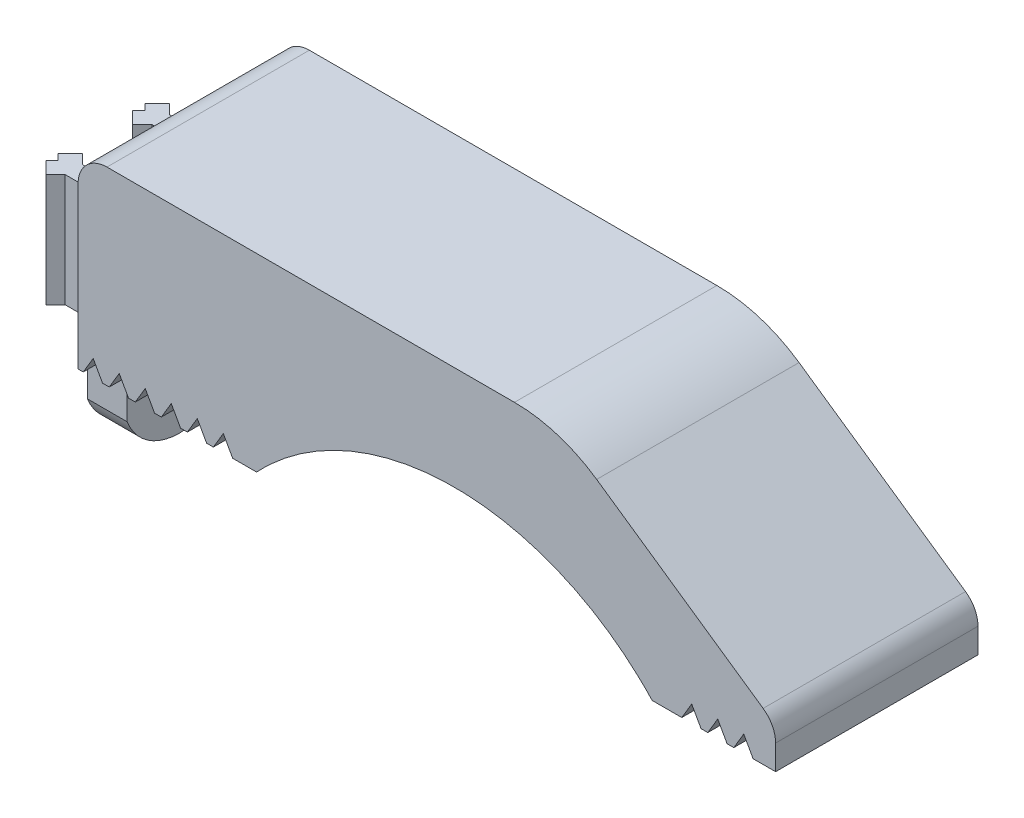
ISO-10303-21;
HEADER;
FILE_DESCRIPTION(('STEP AP214'),'2;1');
FILE_NAME('part.step','',(''),(''),'','','');
FILE_SCHEMA(('AUTOMOTIVE_DESIGN { 1 0 10303 214 1 1 1 1 }'));
ENDSEC;
DATA;
#1=APPLICATION_CONTEXT('core data for automotive mechanical design processes');
#2=APPLICATION_PROTOCOL_DEFINITION('international standard','automotive_design',2000,#1);
#3=PRODUCT_CONTEXT('',#1,'mechanical');
#4=PRODUCT('Part','Part','',(#3));
#5=PRODUCT_RELATED_PRODUCT_CATEGORY('part','',(#4));
#6=PRODUCT_DEFINITION_FORMATION('','',#4);
#7=PRODUCT_DEFINITION_CONTEXT('part definition',#1,'design');
#8=PRODUCT_DEFINITION('design','',#6,#7);
#9=PRODUCT_DEFINITION_SHAPE('','',#8);
#10=(LENGTH_UNIT() NAMED_UNIT(*) SI_UNIT(.MILLI.,.METRE.));
#11=(NAMED_UNIT(*) PLANE_ANGLE_UNIT() SI_UNIT($,.RADIAN.));
#12=(NAMED_UNIT(*) SI_UNIT($,.STERADIAN.) SOLID_ANGLE_UNIT());
#13=UNCERTAINTY_MEASURE_WITH_UNIT(LENGTH_MEASURE(1.E-05),#10,'distance_accuracy_value','');
#14=(GEOMETRIC_REPRESENTATION_CONTEXT(3) GLOBAL_UNCERTAINTY_ASSIGNED_CONTEXT((#13)) GLOBAL_UNIT_ASSIGNED_CONTEXT((#10,
#11,#12)) REPRESENTATION_CONTEXT('',''));
#15=CARTESIAN_POINT('',(0.,0.,0.));
#16=DIRECTION('',(0.,0.,1.));
#17=DIRECTION('',(1.,0.,0.));
#18=AXIS2_PLACEMENT_3D('',#15,#16,#17);
#19=CARTESIAN_POINT('',(-16.5682233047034,-7.35,-16.5682233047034));
#20=DIRECTION('',(-0.707106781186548,0.,-0.707106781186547));
#21=DIRECTION('',(-0.707106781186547,0.,0.707106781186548));
#22=AXIS2_PLACEMENT_3D('',#19,#20,#21);
#23=PLANE('',#22);
#24=DIRECTION('',(-0.707106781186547,0.,0.707106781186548));
#25=VECTOR('',#24,1.);
#26=CARTESIAN_POINT('',(-16.5682233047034,7.79999999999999,-16.5682233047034));
#27=LINE('',#26,#25);
#28=CARTESIAN_POINT('',(-30.1364466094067,7.79999999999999,-3.));
#29=VERTEX_POINT('',#28);
#30=CARTESIAN_POINT('',(-30.5521677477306,7.79999999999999,-2.58427886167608));
#31=VERTEX_POINT('',#30);
#32=EDGE_CURVE('E78',#29,#31,#27,.T.);
#33=ORIENTED_EDGE('',*,*,#32,.F.);
#34=DIRECTION('',(0.,1.,0.));
#35=VECTOR('',#34,1.);
#36=CARTESIAN_POINT('',(-30.1364466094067,-1.97150240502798,-3.));
#37=LINE('',#36,#35);
#38=CARTESIAN_POINT('',(-30.1364466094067,0.,-3.));
#39=VERTEX_POINT('',#38);
#40=EDGE_CURVE('E82',#39,#29,#37,.T.);
#41=ORIENTED_EDGE('',*,*,#40,.F.);
#42=DIRECTION('',(-0.707106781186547,0.,0.707106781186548));
#43=VECTOR('',#42,1.);
#44=CARTESIAN_POINT('',(-16.5682233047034,0.,-16.5682233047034));
#45=LINE('',#44,#43);
#46=CARTESIAN_POINT('',(-30.5521677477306,0.,-2.58427886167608));
#47=VERTEX_POINT('',#46);
#48=EDGE_CURVE('E858',#39,#47,#45,.T.);
#49=ORIENTED_EDGE('',*,*,#48,.T.);
#50=DIRECTION('',(0.,1.,0.));
#51=VECTOR('',#50,1.);
#52=CARTESIAN_POINT('',(-30.5521677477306,-7.35000000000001,-2.58427886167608));
#53=LINE('',#52,#51);
#54=EDGE_CURVE('E543',#47,#31,#53,.T.);
#55=ORIENTED_EDGE('',*,*,#54,.T.);
#56=EDGE_LOOP('',(#33,#41,#49,#55));
#57=FACE_BOUND('',#56,.T.);
#58=ADVANCED_FACE('F63',(#57),#23,.T.);
#59=CARTESIAN_POINT('',(0.,-7.35,-3.6));
#60=DIRECTION('',(0.,0.,-1.));
#61=DIRECTION('',(-1.,0.,0.));
#62=AXIS2_PLACEMENT_3D('',#59,#60,#61);
#63=PLANE('',#62);
#64=DIRECTION('',(-1.,0.,0.));
#65=VECTOR('',#64,1.);
#66=CARTESIAN_POINT('',(0.,0.,-3.6));
#67=LINE('',#66,#65);
#68=CARTESIAN_POINT('',(-27.5,0.,-3.6));
#69=VERTEX_POINT('',#68);
#70=CARTESIAN_POINT('',(-29.039390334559,0.,-3.6));
#71=VERTEX_POINT('',#70);
#72=EDGE_CURVE('E555',#69,#71,#67,.T.);
#73=ORIENTED_EDGE('',*,*,#72,.T.);
#74=DIRECTION('',(0.,1.,0.));
#75=VECTOR('',#74,1.);
#76=CARTESIAN_POINT('',(-29.039390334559,-1.97150240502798,-3.6));
#77=LINE('',#76,#75);
#78=CARTESIAN_POINT('',(-29.039390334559,7.79999999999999,-3.6));
#79=VERTEX_POINT('',#78);
#80=EDGE_CURVE('E449',#71,#79,#77,.T.);
#81=ORIENTED_EDGE('',*,*,#80,.T.);
#82=DIRECTION('',(-1.,0.,0.));
#83=VECTOR('',#82,1.);
#84=CARTESIAN_POINT('',(0.,7.8,-3.6));
#85=LINE('',#84,#83);
#86=CARTESIAN_POINT('',(-24.75,7.79999999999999,-3.6));
#87=VERTEX_POINT('',#86);
#88=EDGE_CURVE('E462',#87,#79,#85,.T.);
#89=ORIENTED_EDGE('',*,*,#88,.F.);
#90=DIRECTION('',(0.,1.,0.));
#91=VECTOR('',#90,1.);
#92=CARTESIAN_POINT('',(-24.75,-7.35000000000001,-3.6));
#93=LINE('',#92,#91);
#94=CARTESIAN_POINT('',(-24.75,0.,-3.6));
#95=VERTEX_POINT('',#94);
#96=EDGE_CURVE('E540',#95,#87,#93,.T.);
#97=ORIENTED_EDGE('',*,*,#96,.F.);
#98=CARTESIAN_POINT('',(-24.75,-4.86473440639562,-3.6));
#99=VERTEX_POINT('',#98);
#100=EDGE_CURVE('E502',#99,#95,#93,.T.);
#101=ORIENTED_EDGE('',*,*,#100,.F.);
#102=DIRECTION('',(1.,0.,0.));
#103=VECTOR('',#102,1.);
#104=CARTESIAN_POINT('',(0.,-4.86473440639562,-3.6));
#105=LINE('',#104,#103);
#106=CARTESIAN_POINT('',(-27.5,-4.86473440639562,-3.6));
#107=VERTEX_POINT('',#106);
#108=EDGE_CURVE('E517',#107,#99,#105,.T.);
#109=ORIENTED_EDGE('',*,*,#108,.F.);
#110=DIRECTION('',(0.,1.,0.));
#111=VECTOR('',#110,1.);
#112=CARTESIAN_POINT('',(-27.5,10.,-3.6));
#113=LINE('',#112,#111);
#114=EDGE_CURVE('E553',#107,#69,#113,.T.);
#115=ORIENTED_EDGE('',*,*,#114,.T.);
#116=EDGE_LOOP('',(#73,#81,#89,#97,#101,#109,#115));
#117=FACE_BOUND('',#116,.T.);
#118=ADVANCED_FACE('F909',(#117),#63,.T.);
#119=CARTESIAN_POINT('',(-13.5682233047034,-7.35,-13.5682233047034));
#120=DIRECTION('',(-0.707106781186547,0.,-0.707106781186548));
#121=DIRECTION('',(-0.707106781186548,0.,0.707106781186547));
#122=AXIS2_PLACEMENT_3D('',#119,#120,#121);
#123=PLANE('',#122);
#124=DIRECTION('',(-0.707106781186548,0.,0.707106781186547));
#125=VECTOR('',#124,1.);
#126=CARTESIAN_POINT('',(-13.5682233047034,7.79999999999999,-13.5682233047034));
#127=LINE('',#126,#125);
#128=CARTESIAN_POINT('',(-30.1364466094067,7.79999999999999,3.00000000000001));
#129=VERTEX_POINT('',#128);
#130=CARTESIAN_POINT('',(-30.5521677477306,7.79999999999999,3.41572113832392));
#131=VERTEX_POINT('',#130);
#132=EDGE_CURVE('E508',#129,#131,#127,.T.);
#133=ORIENTED_EDGE('',*,*,#132,.F.);
#134=DIRECTION('',(0.,1.,0.));
#135=VECTOR('',#134,1.);
#136=CARTESIAN_POINT('',(-30.1364466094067,-1.97150240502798,3.));
#137=LINE('',#136,#135);
#138=CARTESIAN_POINT('',(-30.1364466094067,0.,3.));
#139=VERTEX_POINT('',#138);
#140=EDGE_CURVE('E490',#139,#129,#137,.T.);
#141=ORIENTED_EDGE('',*,*,#140,.F.);
#142=DIRECTION('',(-0.707106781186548,0.,0.707106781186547));
#143=VECTOR('',#142,1.);
#144=CARTESIAN_POINT('',(-13.5682233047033,0.,-13.5682233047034));
#145=LINE('',#144,#143);
#146=CARTESIAN_POINT('',(-30.5521677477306,0.,3.41572113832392));
#147=VERTEX_POINT('',#146);
#148=EDGE_CURVE('E13',#139,#147,#145,.T.);
#149=ORIENTED_EDGE('',*,*,#148,.T.);
#150=DIRECTION('',(0.,1.,0.));
#151=VECTOR('',#150,1.);
#152=CARTESIAN_POINT('',(-30.5521677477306,-7.35000000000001,3.41572113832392));
#153=LINE('',#152,#151);
#154=EDGE_CURVE('E518',#147,#131,#153,.T.);
#155=ORIENTED_EDGE('',*,*,#154,.T.);
#156=EDGE_LOOP('',(#133,#141,#149,#155));
#157=FACE_BOUND('',#156,.T.);
#158=ADVANCED_FACE('F952',(#157),#123,.T.);
#159=CARTESIAN_POINT('',(0.,-7.35,2.4));
#160=DIRECTION('',(0.,0.,-1.));
#161=DIRECTION('',(-1.,0.,0.));
#162=AXIS2_PLACEMENT_3D('',#159,#160,#161);
#163=PLANE('',#162);
#164=DIRECTION('',(-1.,0.,0.));
#165=VECTOR('',#164,1.);
#166=CARTESIAN_POINT('',(0.,0.,2.4));
#167=LINE('',#166,#165);
#168=CARTESIAN_POINT('',(-27.5,0.,2.4));
#169=VERTEX_POINT('',#168);
#170=CARTESIAN_POINT('',(-29.039390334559,0.,2.4));
#171=VERTEX_POINT('',#170);
#172=EDGE_CURVE('E567',#169,#171,#167,.T.);
#173=ORIENTED_EDGE('',*,*,#172,.T.);
#174=DIRECTION('',(0.,1.,0.));
#175=VECTOR('',#174,1.);
#176=CARTESIAN_POINT('',(-29.039390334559,-1.97150240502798,2.4));
#177=LINE('',#176,#175);
#178=CARTESIAN_POINT('',(-29.039390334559,7.79999999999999,2.4));
#179=VERTEX_POINT('',#178);
#180=EDGE_CURVE('E494',#171,#179,#177,.T.);
#181=ORIENTED_EDGE('',*,*,#180,.T.);
#182=DIRECTION('',(-1.,0.,0.));
#183=VECTOR('',#182,1.);
#184=CARTESIAN_POINT('',(0.,7.8,2.4));
#185=LINE('',#184,#183);
#186=CARTESIAN_POINT('',(-27.5,7.79999999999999,2.4));
#187=VERTEX_POINT('',#186);
#188=EDGE_CURVE('E510',#187,#179,#185,.T.);
#189=ORIENTED_EDGE('',*,*,#188,.F.);
#190=DIRECTION('',(0.,1.,0.));
#191=VECTOR('',#190,1.);
#192=CARTESIAN_POINT('',(-27.5,-7.35000000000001,2.4));
#193=LINE('',#192,#191);
#194=EDGE_CURVE('E514',#169,#187,#193,.T.);
#195=ORIENTED_EDGE('',*,*,#194,.F.);
#196=EDGE_LOOP('',(#173,#181,#189,#195));
#197=FACE_BOUND('',#196,.T.);
#198=ADVANCED_FACE('F953',(#197),#163,.T.);
#199=CARTESIAN_POINT('',(27.5,7.8,-3.88));
#200=DIRECTION('',(0.,-1.,0.));
#201=DIRECTION('',(1.,0.,0.));
#202=AXIS2_PLACEMENT_3D('',#199,#200,#201);
#203=PLANE('',#202);
#204=DIRECTION('',(-0.707106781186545,0.,-0.70710678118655));
#205=VECTOR('',#204,1.);
#206=CARTESIAN_POINT('',(-13.5682233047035,7.79999999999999,13.5682233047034));
#207=LINE('',#206,#205);
#208=CARTESIAN_POINT('',(-30.5521677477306,7.79999999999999,-3.41572113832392));
#209=VERTEX_POINT('',#208);
#210=EDGE_CURVE('E463',#29,#209,#207,.T.);
#211=ORIENTED_EDGE('',*,*,#210,.F.);
#212=ORIENTED_EDGE('',*,*,#32,.T.);
#213=DIRECTION('',(0.707106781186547,0.,0.707106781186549));
#214=VECTOR('',#213,1.);
#215=CARTESIAN_POINT('',(-13.9839444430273,7.79999999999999,13.9839444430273));
#216=LINE('',#215,#214);
#217=CARTESIAN_POINT('',(-29.7036396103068,7.79999999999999,-1.73575072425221));
#218=VERTEX_POINT('',#217);
#219=EDGE_CURVE('E534',#31,#218,#216,.T.);
#220=ORIENTED_EDGE('',*,*,#219,.T.);
#221=DIRECTION('',(0.707106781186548,0.,-0.707106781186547));
#222=VECTOR('',#221,1.);
#223=CARTESIAN_POINT('',(-15.7196951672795,7.79999999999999,-15.7196951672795));
#224=LINE('',#223,#222);
#225=CARTESIAN_POINT('',(-29.039390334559,7.79999999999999,-2.4));
#226=VERTEX_POINT('',#225);
#227=EDGE_CURVE('E530',#218,#226,#224,.T.);
#228=ORIENTED_EDGE('',*,*,#227,.T.);
#229=DIRECTION('',(1.,0.,0.));
#230=VECTOR('',#229,1.);
#231=CARTESIAN_POINT('',(0.,7.8,-2.4));
#232=LINE('',#231,#230);
#233=CARTESIAN_POINT('',(-27.5,7.79999999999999,-2.4));
#234=VERTEX_POINT('',#233);
#235=EDGE_CURVE('E527',#226,#234,#232,.T.);
#236=ORIENTED_EDGE('',*,*,#235,.T.);
#237=DIRECTION('',(0.,0.,-1.));
#238=VECTOR('',#237,1.);
#239=CARTESIAN_POINT('',(-27.5,7.79999999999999,0.));
#240=LINE('',#239,#238);
#241=EDGE_CURVE('E787',#187,#234,#240,.T.);
#242=ORIENTED_EDGE('',*,*,#241,.F.);
#243=ORIENTED_EDGE('',*,*,#188,.T.);
#244=DIRECTION('',(0.707106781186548,0.,0.707106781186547));
#245=VECTOR('',#244,1.);
#246=CARTESIAN_POINT('',(-15.7196951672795,7.79999999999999,15.7196951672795));
#247=LINE('',#246,#245);
#248=CARTESIAN_POINT('',(-29.7036396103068,7.79999999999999,1.73575072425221));
#249=VERTEX_POINT('',#248);
#250=EDGE_CURVE('E484',#249,#179,#247,.T.);
#251=ORIENTED_EDGE('',*,*,#250,.F.);
#252=DIRECTION('',(0.707106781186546,0.,-0.707106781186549));
#253=VECTOR('',#252,1.);
#254=CARTESIAN_POINT('',(-13.9839444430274,7.79999999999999,-13.9839444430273));
#255=LINE('',#254,#253);
#256=CARTESIAN_POINT('',(-30.5521677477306,7.79999999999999,2.58427886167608));
#257=VERTEX_POINT('',#256);
#258=EDGE_CURVE('E487',#257,#249,#255,.T.);
#259=ORIENTED_EDGE('',*,*,#258,.F.);
#260=DIRECTION('',(-0.707106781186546,0.,-0.707106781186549));
#261=VECTOR('',#260,1.);
#262=CARTESIAN_POINT('',(-16.5682233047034,7.79999999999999,16.5682233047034));
#263=LINE('',#262,#261);
#264=EDGE_CURVE('E481',#129,#257,#263,.T.);
#265=ORIENTED_EDGE('',*,*,#264,.F.);
#266=ORIENTED_EDGE('',*,*,#132,.T.);
#267=DIRECTION('',(0.707106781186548,0.,0.707106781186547));
#268=VECTOR('',#267,1.);
#269=CARTESIAN_POINT('',(-16.9839444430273,7.79999999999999,16.9839444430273));
#270=LINE('',#269,#268);
#271=CARTESIAN_POINT('',(-29.7036396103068,7.79999999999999,4.26424927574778));
#272=VERTEX_POINT('',#271);
#273=EDGE_CURVE('E505',#131,#272,#270,.T.);
#274=ORIENTED_EDGE('',*,*,#273,.T.);
#275=DIRECTION('',(0.707106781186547,0.,-0.707106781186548));
#276=VECTOR('',#275,1.);
#277=CARTESIAN_POINT('',(-12.7196951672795,7.79999999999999,-12.7196951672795));
#278=LINE('',#277,#276);
#279=CARTESIAN_POINT('',(-29.039390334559,7.79999999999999,3.6));
#280=VERTEX_POINT('',#279);
#281=EDGE_CURVE('E501',#272,#280,#278,.T.);
#282=ORIENTED_EDGE('',*,*,#281,.T.);
#283=DIRECTION('',(1.,0.,0.));
#284=VECTOR('',#283,1.);
#285=CARTESIAN_POINT('',(0.,7.8,3.6));
#286=LINE('',#285,#284);
#287=CARTESIAN_POINT('',(-24.75,7.79999999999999,3.6));
#288=VERTEX_POINT('',#287);
#289=EDGE_CURVE('E498',#280,#288,#286,.T.);
#290=ORIENTED_EDGE('',*,*,#289,.T.);
#291=DIRECTION('',(0.,0.,1.));
#292=VECTOR('',#291,1.);
#293=CARTESIAN_POINT('',(-24.75,7.79999999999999,-3.88));
#294=LINE('',#293,#292);
#295=EDGE_CURVE('E771',#87,#288,#294,.T.);
#296=ORIENTED_EDGE('',*,*,#295,.F.);
#297=ORIENTED_EDGE('',*,*,#88,.T.);
#298=DIRECTION('',(0.707106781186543,0.,0.707106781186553));
#299=VECTOR('',#298,1.);
#300=CARTESIAN_POINT('',(-12.7196951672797,7.79999999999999,12.7196951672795));
#301=LINE('',#300,#299);
#302=CARTESIAN_POINT('',(-29.7036396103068,7.79999999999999,-4.26424927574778));
#303=VERTEX_POINT('',#302);
#304=EDGE_CURVE('E443',#303,#79,#301,.T.);
#305=ORIENTED_EDGE('',*,*,#304,.F.);
#306=DIRECTION('',(0.707106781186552,0.,-0.707106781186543));
#307=VECTOR('',#306,1.);
#308=CARTESIAN_POINT('',(-16.9839444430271,7.79999999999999,-16.9839444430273));
#309=LINE('',#308,#307);
#310=EDGE_CURVE('E452',#209,#303,#309,.T.);
#311=ORIENTED_EDGE('',*,*,#310,.F.);
#312=EDGE_LOOP('',(#211,#212,#220,#228,#236,#242,#243,#251,#259,#265,#266,#274,#282,#290,#296,
#297,#305,#311));
#313=FACE_BOUND('',#312,.T.);
#314=ADVANCED_FACE('F460',(#313),#203,.F.);
#315=CARTESIAN_POINT('',(0.,0.,0.));
#316=DIRECTION('',(0.,1.,0.));
#317=DIRECTION('',(0.,0.,1.));
#318=AXIS2_PLACEMENT_3D('',#315,#316,#317);
#319=PLANE('',#318);
#320=ORIENTED_EDGE('',*,*,#148,.F.);
#321=DIRECTION('',(0.707106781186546,0.,0.707106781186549));
#322=VECTOR('',#321,1.);
#323=CARTESIAN_POINT('',(-16.5682233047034,0.,16.5682233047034));
#324=LINE('',#323,#322);
#325=CARTESIAN_POINT('',(-30.5521677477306,0.,2.58427886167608));
#326=VERTEX_POINT('',#325);
#327=EDGE_CURVE('E465',#326,#139,#324,.T.);
#328=ORIENTED_EDGE('',*,*,#327,.F.);
#329=DIRECTION('',(-0.707106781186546,0.,0.70710678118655));
#330=VECTOR('',#329,1.);
#331=CARTESIAN_POINT('',(-13.9839444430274,0.,-13.9839444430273));
#332=LINE('',#331,#330);
#333=CARTESIAN_POINT('',(-29.7036396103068,0.,1.73575072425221));
#334=VERTEX_POINT('',#333);
#335=EDGE_CURVE('E475',#334,#326,#332,.T.);
#336=ORIENTED_EDGE('',*,*,#335,.F.);
#337=DIRECTION('',(-0.707106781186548,0.,-0.707106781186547));
#338=VECTOR('',#337,1.);
#339=CARTESIAN_POINT('',(-15.7196951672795,0.,15.7196951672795));
#340=LINE('',#339,#338);
#341=EDGE_CURVE('E472',#171,#334,#340,.T.);
#342=ORIENTED_EDGE('',*,*,#341,.F.);
#343=ORIENTED_EDGE('',*,*,#172,.F.);
#344=DIRECTION('',(0.,0.,-1.));
#345=VECTOR('',#344,1.);
#346=CARTESIAN_POINT('',(-27.5,0.,3.85));
#347=LINE('',#346,#345);
#348=CARTESIAN_POINT('',(-27.5,0.,3.6));
#349=VERTEX_POINT('',#348);
#350=EDGE_CURVE('E784',#349,#169,#347,.T.);
#351=ORIENTED_EDGE('',*,*,#350,.F.);
#352=DIRECTION('',(1.,0.,0.));
#353=VECTOR('',#352,1.);
#354=CARTESIAN_POINT('',(0.,0.,3.6));
#355=LINE('',#354,#353);
#356=CARTESIAN_POINT('',(-29.039390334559,0.,3.6));
#357=VERTEX_POINT('',#356);
#358=EDGE_CURVE('E563',#357,#349,#355,.T.);
#359=ORIENTED_EDGE('',*,*,#358,.F.);
#360=DIRECTION('',(0.707106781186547,0.,-0.707106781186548));
#361=VECTOR('',#360,1.);
#362=CARTESIAN_POINT('',(-12.7196951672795,0.,-12.7196951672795));
#363=LINE('',#362,#361);
#364=CARTESIAN_POINT('',(-29.7036396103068,0.,4.26424927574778));
#365=VERTEX_POINT('',#364);
#366=EDGE_CURVE('E860',#365,#357,#363,.T.);
#367=ORIENTED_EDGE('',*,*,#366,.F.);
#368=DIRECTION('',(0.707106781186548,0.,0.707106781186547));
#369=VECTOR('',#368,1.);
#370=CARTESIAN_POINT('',(-16.9839444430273,0.,16.9839444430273));
#371=LINE('',#370,#369);
#372=EDGE_CURVE('E71',#147,#365,#371,.T.);
#373=ORIENTED_EDGE('',*,*,#372,.F.);
#374=EDGE_LOOP('',(#320,#328,#336,#342,#343,#351,#359,#367,#373));
#375=FACE_BOUND('',#374,.T.);
#376=ADVANCED_FACE('F875',(#375),#319,.F.);
#377=ORIENTED_EDGE('',*,*,#48,.F.);
#378=DIRECTION('',(0.707106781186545,0.,0.70710678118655));
#379=VECTOR('',#378,1.);
#380=CARTESIAN_POINT('',(-13.5682233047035,0.,13.5682233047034));
#381=LINE('',#380,#379);
#382=CARTESIAN_POINT('',(-30.5521677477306,0.,-3.41572113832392));
#383=VERTEX_POINT('',#382);
#384=EDGE_CURVE('E531',#383,#39,#381,.T.);
#385=ORIENTED_EDGE('',*,*,#384,.F.);
#386=DIRECTION('',(-0.707106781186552,0.,0.707106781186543));
#387=VECTOR('',#386,1.);
#388=CARTESIAN_POINT('',(-16.9839444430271,0.,-16.9839444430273));
#389=LINE('',#388,#387);
#390=CARTESIAN_POINT('',(-29.7036396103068,0.,-4.26424927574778));
#391=VERTEX_POINT('',#390);
#392=EDGE_CURVE('E914',#391,#383,#389,.T.);
#393=ORIENTED_EDGE('',*,*,#392,.F.);
#394=DIRECTION('',(-0.707106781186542,0.,-0.707106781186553));
#395=VECTOR('',#394,1.);
#396=CARTESIAN_POINT('',(-12.7196951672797,0.,12.7196951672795));
#397=LINE('',#396,#395);
#398=EDGE_CURVE('E445',#71,#391,#397,.T.);
#399=ORIENTED_EDGE('',*,*,#398,.F.);
#400=ORIENTED_EDGE('',*,*,#72,.F.);
#401=CARTESIAN_POINT('',(-27.5,0.,-2.4));
#402=VERTEX_POINT('',#401);
#403=EDGE_CURVE('E781',#402,#69,#347,.T.);
#404=ORIENTED_EDGE('',*,*,#403,.F.);
#405=DIRECTION('',(1.,0.,0.));
#406=VECTOR('',#405,1.);
#407=CARTESIAN_POINT('',(0.,0.,-2.4));
#408=LINE('',#407,#406);
#409=CARTESIAN_POINT('',(-29.039390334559,0.,-2.4));
#410=VERTEX_POINT('',#409);
#411=EDGE_CURVE('E565',#410,#402,#408,.T.);
#412=ORIENTED_EDGE('',*,*,#411,.F.);
#413=DIRECTION('',(0.707106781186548,0.,-0.707106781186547));
#414=VECTOR('',#413,1.);
#415=CARTESIAN_POINT('',(-15.7196951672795,0.,-15.7196951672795));
#416=LINE('',#415,#414);
#417=CARTESIAN_POINT('',(-29.7036396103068,0.,-1.73575072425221));
#418=VERTEX_POINT('',#417);
#419=EDGE_CURVE('E854',#418,#410,#416,.T.);
#420=ORIENTED_EDGE('',*,*,#419,.F.);
#421=DIRECTION('',(0.707106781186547,0.,0.707106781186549));
#422=VECTOR('',#421,1.);
#423=CARTESIAN_POINT('',(-13.9839444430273,0.,13.9839444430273));
#424=LINE('',#423,#422);
#425=EDGE_CURVE('E856',#47,#418,#424,.T.);
#426=ORIENTED_EDGE('',*,*,#425,.F.);
#427=EDGE_LOOP('',(#377,#385,#393,#399,#400,#404,#412,#420,#426));
#428=FACE_BOUND('',#427,.T.);
#429=ADVANCED_FACE('F913',(#428),#319,.F.);
#430=CARTESIAN_POINT('',(-24.75,-7.35,3.85));
#431=DIRECTION('',(-1.,0.,0.));
#432=DIRECTION('',(0.,0.,1.));
#433=AXIS2_PLACEMENT_3D('',#430,#431,#432);
#434=PLANE('',#433);
#435=CARTESIAN_POINT('',(-24.75,-3.5,0.));
#436=DIRECTION('',(1.,0.,0.));
#437=DIRECTION('',(0.,0.,-1.));
#438=AXIS2_PLACEMENT_3D('',#435,#436,#437);
#439=CIRCLE('',#438,0.75);
#440=CARTESIAN_POINT('',(-24.75,-3.5,-0.75));
#441=VERTEX_POINT('',#440);
#442=EDGE_CURVE('E775',#441,#441,#439,.T.);
#443=ORIENTED_EDGE('',*,*,#442,.F.);
#444=EDGE_LOOP('',(#443));
#445=FACE_BOUND('',#444,.T.);
#446=DIRECTION('',(0.,1.,0.));
#447=VECTOR('',#446,1.);
#448=CARTESIAN_POINT('',(-24.75,-7.35000000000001,3.6));
#449=LINE('',#448,#447);
#450=CARTESIAN_POINT('',(-24.75,-4.86473440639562,3.6));
#451=VERTEX_POINT('',#450);
#452=CARTESIAN_POINT('',(-24.75,0.,3.6));
#453=VERTEX_POINT('',#452);
#454=EDGE_CURVE('E525',#451,#453,#449,.T.);
#455=ORIENTED_EDGE('',*,*,#454,.F.);
#456=CARTESIAN_POINT('',(-24.75,-3.5,0.));
#457=DIRECTION('',(-1.,0.,0.));
#458=DIRECTION('',(0.,0.,1.));
#459=AXIS2_PLACEMENT_3D('',#456,#457,#458);
#460=CIRCLE('',#459,3.85);
#461=CARTESIAN_POINT('',(-24.75,-7.35,0.));
#462=VERTEX_POINT('',#461);
#463=EDGE_CURVE('E791',#451,#462,#460,.F.);
#464=ORIENTED_EDGE('',*,*,#463,.T.);
#465=CARTESIAN_POINT('',(-24.75,-3.5,0.));
#466=DIRECTION('',(-1.,0.,0.));
#467=DIRECTION('',(0.,0.,1.));
#468=AXIS2_PLACEMENT_3D('',#465,#466,#467);
#469=CIRCLE('',#468,3.85);
#470=EDGE_CURVE('E793',#462,#99,#469,.F.);
#471=ORIENTED_EDGE('',*,*,#470,.T.);
#472=ORIENTED_EDGE('',*,*,#100,.T.);
#473=DIRECTION('',(0.,0.,1.));
#474=VECTOR('',#473,1.);
#475=CARTESIAN_POINT('',(-24.75,0.,3.85));
#476=LINE('',#475,#474);
#477=EDGE_CURVE('E788',#95,#453,#476,.T.);
#478=ORIENTED_EDGE('',*,*,#477,.T.);
#479=EDGE_LOOP('',(#455,#464,#471,#472,#478));
#480=FACE_BOUND('',#479,.T.);
#481=ADVANCED_FACE('F899',(#445,#480),#434,.F.);
#482=CARTESIAN_POINT('',(0.,-3.5,0.));
#483=DIRECTION('',(1.,0.,0.));
#484=DIRECTION('',(0.,0.,-1.));
#485=AXIS2_PLACEMENT_3D('',#482,#483,#484);
#486=CYLINDRICAL_SURFACE('',#485,3.85);
#487=ORIENTED_EDGE('',*,*,#463,.F.);
#488=DIRECTION('',(1.,0.,0.));
#489=VECTOR('',#488,1.);
#490=CARTESIAN_POINT('',(0.,-4.8647344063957,3.6));
#491=LINE('',#490,#489);
#492=CARTESIAN_POINT('',(-27.5,-4.8647344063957,3.59999999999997));
#493=VERTEX_POINT('',#492);
#494=EDGE_CURVE('E557',#451,#493,#491,.F.);
#495=ORIENTED_EDGE('',*,*,#494,.T.);
#496=CARTESIAN_POINT('',(-27.5,-3.5,0.));
#497=DIRECTION('',(1.,0.,0.));
#498=DIRECTION('',(0.,0.,-1.));
#499=AXIS2_PLACEMENT_3D('',#496,#497,#498);
#500=CIRCLE('',#499,3.85);
#501=CARTESIAN_POINT('',(-27.5,-7.35,0.));
#502=VERTEX_POINT('',#501);
#503=EDGE_CURVE('E796',#502,#493,#500,.F.);
#504=ORIENTED_EDGE('',*,*,#503,.F.);
#505=DIRECTION('',(-1.,0.,0.));
#506=VECTOR('',#505,1.);
#507=CARTESIAN_POINT('',(-27.5,-7.35,0.));
#508=LINE('',#507,#506);
#509=EDGE_CURVE('E774',#462,#502,#508,.T.);
#510=ORIENTED_EDGE('',*,*,#509,.F.);
#511=EDGE_LOOP('',(#487,#495,#504,#510));
#512=FACE_BOUND('',#511,.T.);
#513=ADVANCED_FACE('F892',(#512),#486,.T.);
#514=CARTESIAN_POINT('',(0.,-3.5,0.));
#515=DIRECTION('',(1.,0.,0.));
#516=DIRECTION('',(0.,0.,-1.));
#517=AXIS2_PLACEMENT_3D('',#514,#515,#516);
#518=CYLINDRICAL_SURFACE('',#517,3.85);
#519=CARTESIAN_POINT('',(-27.5,-3.5,0.));
#520=DIRECTION('',(1.,0.,0.));
#521=DIRECTION('',(0.,0.,-1.));
#522=AXIS2_PLACEMENT_3D('',#519,#520,#521);
#523=CIRCLE('',#522,3.85);
#524=EDGE_CURVE('E798',#107,#502,#523,.F.);
#525=ORIENTED_EDGE('',*,*,#524,.F.);
#526=ORIENTED_EDGE('',*,*,#108,.T.);
#527=ORIENTED_EDGE('',*,*,#470,.F.);
#528=ORIENTED_EDGE('',*,*,#509,.T.);
#529=EDGE_LOOP('',(#525,#526,#527,#528));
#530=FACE_BOUND('',#529,.T.);
#531=ADVANCED_FACE('F895',(#530),#518,.T.);
#532=DIRECTION('',(1.,0.,0.));
#533=VECTOR('',#532,1.);
#534=CARTESIAN_POINT('',(0.,0.,7.));
#535=LINE('',#534,#533);
#536=CARTESIAN_POINT('',(18.3430597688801,0.,7.));
#537=VERTEX_POINT('',#536);
#538=CARTESIAN_POINT('',(18.8086833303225,0.,7.));
#539=VERTEX_POINT('',#538);
#540=EDGE_CURVE('E1158',#537,#539,#535,.T.);
#541=ORIENTED_EDGE('',*,*,#540,.F.);
#542=DIRECTION('',(0.,0.,-1.));
#543=VECTOR('',#542,1.);
#544=CARTESIAN_POINT('',(18.3430597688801,0.,0.));
#545=LINE('',#544,#543);
#546=CARTESIAN_POINT('',(18.3430597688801,0.,-7.));
#547=VERTEX_POINT('',#546);
#548=EDGE_CURVE('E707',#537,#547,#545,.T.);
#549=ORIENTED_EDGE('',*,*,#548,.T.);
#550=DIRECTION('',(1.,0.,0.));
#551=VECTOR('',#550,1.);
#552=CARTESIAN_POINT('',(0.,0.,-7.));
#553=LINE('',#552,#551);
#554=CARTESIAN_POINT('',(18.8086833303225,0.,-7.));
#555=VERTEX_POINT('',#554);
#556=EDGE_CURVE('E1119',#547,#555,#553,.T.);
#557=ORIENTED_EDGE('',*,*,#556,.T.);
#558=DIRECTION('',(0.,0.,1.));
#559=VECTOR('',#558,1.);
#560=CARTESIAN_POINT('',(18.8086833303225,0.,-7.));
#561=LINE('',#560,#559);
#562=EDGE_CURVE('E672',#555,#539,#561,.T.);
#563=ORIENTED_EDGE('',*,*,#562,.T.);
#564=EDGE_LOOP('',(#541,#549,#557,#563));
#565=FACE_BOUND('',#564,.T.);
#566=ADVANCED_FACE('F1093',(#565),#319,.F.);
#567=CARTESIAN_POINT('',(20.1430597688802,0.,7.));
#568=VERTEX_POINT('',#567);
#569=CARTESIAN_POINT('',(20.6086833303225,0.,7.));
#570=VERTEX_POINT('',#569);
#571=EDGE_CURVE('E1160',#568,#570,#535,.T.);
#572=ORIENTED_EDGE('',*,*,#571,.F.);
#573=DIRECTION('',(0.,0.,-1.));
#574=VECTOR('',#573,1.);
#575=CARTESIAN_POINT('',(20.1430597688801,0.,0.));
#576=LINE('',#575,#574);
#577=CARTESIAN_POINT('',(20.1430597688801,0.,-7.));
#578=VERTEX_POINT('',#577);
#579=EDGE_CURVE('E704',#568,#578,#576,.T.);
#580=ORIENTED_EDGE('',*,*,#579,.T.);
#581=CARTESIAN_POINT('',(20.6086833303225,0.,-7.));
#582=VERTEX_POINT('',#581);
#583=EDGE_CURVE('E1117',#578,#582,#553,.T.);
#584=ORIENTED_EDGE('',*,*,#583,.T.);
#585=DIRECTION('',(0.,0.,1.));
#586=VECTOR('',#585,1.);
#587=CARTESIAN_POINT('',(20.6086833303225,0.,-7.));
#588=LINE('',#587,#586);
#589=EDGE_CURVE('E686',#582,#570,#588,.T.);
#590=ORIENTED_EDGE('',*,*,#589,.T.);
#591=EDGE_LOOP('',(#572,#580,#584,#590));
#592=FACE_BOUND('',#591,.T.);
#593=ADVANCED_FACE('F1228',(#592),#319,.F.);
#594=CARTESIAN_POINT('',(21.9430597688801,0.,7.));
#595=VERTEX_POINT('',#594);
#596=CARTESIAN_POINT('',(23.5,0.,7.));
#597=VERTEX_POINT('',#596);
#598=EDGE_CURVE('E735',#595,#597,#535,.T.);
#599=ORIENTED_EDGE('',*,*,#598,.F.);
#600=DIRECTION('',(0.,0.,-1.));
#601=VECTOR('',#600,1.);
#602=CARTESIAN_POINT('',(21.9430597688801,0.,0.));
#603=LINE('',#602,#601);
#604=CARTESIAN_POINT('',(21.9430597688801,0.,-7.));
#605=VERTEX_POINT('',#604);
#606=EDGE_CURVE('E701',#595,#605,#603,.T.);
#607=ORIENTED_EDGE('',*,*,#606,.T.);
#608=CARTESIAN_POINT('',(23.5,0.,-7.));
#609=VERTEX_POINT('',#608);
#610=EDGE_CURVE('E753',#605,#609,#553,.T.);
#611=ORIENTED_EDGE('',*,*,#610,.T.);
#612=DIRECTION('',(0.,0.,1.));
#613=VECTOR('',#612,1.);
#614=CARTESIAN_POINT('',(23.5,0.,0.));
#615=LINE('',#614,#613);
#616=EDGE_CURVE('E790',#609,#597,#615,.T.);
#617=ORIENTED_EDGE('',*,*,#616,.T.);
#618=EDGE_LOOP('',(#599,#607,#611,#617));
#619=FACE_BOUND('',#618,.T.);
#620=ADVANCED_FACE('F1116',(#619),#319,.F.);
#621=CARTESIAN_POINT('',(-23.0569402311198,0.,7.));
#622=VERTEX_POINT('',#621);
#623=CARTESIAN_POINT('',(-22.5913166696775,0.,7.));
#624=VERTEX_POINT('',#623);
#625=EDGE_CURVE('E740',#622,#624,#535,.T.);
#626=ORIENTED_EDGE('',*,*,#625,.F.);
#627=DIRECTION('',(0.,0.,-1.));
#628=VECTOR('',#627,1.);
#629=CARTESIAN_POINT('',(-23.0569402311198,0.,0.));
#630=LINE('',#629,#628);
#631=CARTESIAN_POINT('',(-23.0569402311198,0.,-7.));
#632=VERTEX_POINT('',#631);
#633=EDGE_CURVE('E722',#622,#632,#630,.T.);
#634=ORIENTED_EDGE('',*,*,#633,.T.);
#635=CARTESIAN_POINT('',(-22.5913166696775,0.,-7.));
#636=VERTEX_POINT('',#635);
#637=EDGE_CURVE('E758',#632,#636,#553,.T.);
#638=ORIENTED_EDGE('',*,*,#637,.T.);
#639=DIRECTION('',(0.,0.,1.));
#640=VECTOR('',#639,1.);
#641=CARTESIAN_POINT('',(-22.5913166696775,0.,-7.));
#642=LINE('',#641,#640);
#643=EDGE_CURVE('E586',#636,#624,#642,.T.);
#644=ORIENTED_EDGE('',*,*,#643,.T.);
#645=EDGE_LOOP('',(#626,#634,#638,#644));
#646=FACE_BOUND('',#645,.T.);
#647=ADVANCED_FACE('F1208',(#646),#319,.F.);
#648=CARTESIAN_POINT('',(-21.2569402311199,0.,7.));
#649=VERTEX_POINT('',#648);
#650=CARTESIAN_POINT('',(-20.7913166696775,0.,7.));
#651=VERTEX_POINT('',#650);
#652=EDGE_CURVE('E1165',#649,#651,#535,.T.);
#653=ORIENTED_EDGE('',*,*,#652,.F.);
#654=DIRECTION('',(0.,0.,-1.));
#655=VECTOR('',#654,1.);
#656=CARTESIAN_POINT('',(-21.2569402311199,0.,0.));
#657=LINE('',#656,#655);
#658=CARTESIAN_POINT('',(-21.2569402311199,0.,-7.));
#659=VERTEX_POINT('',#658);
#660=EDGE_CURVE('E719',#649,#659,#657,.T.);
#661=ORIENTED_EDGE('',*,*,#660,.T.);
#662=CARTESIAN_POINT('',(-20.7913166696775,0.,-7.));
#663=VERTEX_POINT('',#662);
#664=EDGE_CURVE('E1121',#659,#663,#553,.T.);
#665=ORIENTED_EDGE('',*,*,#664,.T.);
#666=DIRECTION('',(0.,0.,1.));
#667=VECTOR('',#666,1.);
#668=CARTESIAN_POINT('',(-20.7913166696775,0.,-7.));
#669=LINE('',#668,#667);
#670=EDGE_CURVE('E600',#663,#651,#669,.T.);
#671=ORIENTED_EDGE('',*,*,#670,.T.);
#672=EDGE_LOOP('',(#653,#661,#665,#671));
#673=FACE_BOUND('',#672,.T.);
#674=ADVANCED_FACE('F1206',(#673),#319,.F.);
#675=CARTESIAN_POINT('',(-19.4569402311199,0.,7.));
#676=VERTEX_POINT('',#675);
#677=CARTESIAN_POINT('',(-18.9913166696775,0.,7.));
#678=VERTEX_POINT('',#677);
#679=EDGE_CURVE('E1170',#676,#678,#535,.T.);
#680=ORIENTED_EDGE('',*,*,#679,.F.);
#681=DIRECTION('',(0.,0.,-1.));
#682=VECTOR('',#681,1.);
#683=CARTESIAN_POINT('',(-19.4569402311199,0.,0.));
#684=LINE('',#683,#682);
#685=CARTESIAN_POINT('',(-19.4569402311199,0.,-7.));
#686=VERTEX_POINT('',#685);
#687=EDGE_CURVE('E716',#676,#686,#684,.T.);
#688=ORIENTED_EDGE('',*,*,#687,.T.);
#689=CARTESIAN_POINT('',(-18.9913166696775,0.,-7.));
#690=VERTEX_POINT('',#689);
#691=EDGE_CURVE('E1125',#686,#690,#553,.T.);
#692=ORIENTED_EDGE('',*,*,#691,.T.);
#693=DIRECTION('',(0.,0.,1.));
#694=VECTOR('',#693,1.);
#695=CARTESIAN_POINT('',(-18.9913166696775,0.,-7.));
#696=LINE('',#695,#694);
#697=EDGE_CURVE('E614',#690,#678,#696,.T.);
#698=ORIENTED_EDGE('',*,*,#697,.T.);
#699=EDGE_LOOP('',(#680,#688,#692,#698));
#700=FACE_BOUND('',#699,.T.);
#701=ADVANCED_FACE('F1204',(#700),#319,.F.);
#702=CARTESIAN_POINT('',(-17.6569402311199,0.,7.));
#703=VERTEX_POINT('',#702);
#704=CARTESIAN_POINT('',(-17.1913166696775,0.,7.));
#705=VERTEX_POINT('',#704);
#706=EDGE_CURVE('E1175',#703,#705,#535,.T.);
#707=ORIENTED_EDGE('',*,*,#706,.F.);
#708=DIRECTION('',(0.,0.,-1.));
#709=VECTOR('',#708,1.);
#710=CARTESIAN_POINT('',(-17.6569402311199,0.,0.));
#711=LINE('',#710,#709);
#712=CARTESIAN_POINT('',(-17.6569402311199,0.,-7.));
#713=VERTEX_POINT('',#712);
#714=EDGE_CURVE('E713',#703,#713,#711,.T.);
#715=ORIENTED_EDGE('',*,*,#714,.T.);
#716=CARTESIAN_POINT('',(-17.1913166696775,0.,-7.));
#717=VERTEX_POINT('',#716);
#718=EDGE_CURVE('E1129',#713,#717,#553,.T.);
#719=ORIENTED_EDGE('',*,*,#718,.T.);
#720=DIRECTION('',(0.,0.,1.));
#721=VECTOR('',#720,1.);
#722=CARTESIAN_POINT('',(-17.1913166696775,0.,-7.));
#723=LINE('',#722,#721);
#724=EDGE_CURVE('E628',#717,#705,#723,.T.);
#725=ORIENTED_EDGE('',*,*,#724,.T.);
#726=EDGE_LOOP('',(#707,#715,#719,#725));
#727=FACE_BOUND('',#726,.T.);
#728=ADVANCED_FACE('F1202',(#727),#319,.F.);
#729=CARTESIAN_POINT('',(-15.8569402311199,0.,7.));
#730=VERTEX_POINT('',#729);
#731=CARTESIAN_POINT('',(-15.3913166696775,0.,7.));
#732=VERTEX_POINT('',#731);
#733=EDGE_CURVE('E1180',#730,#732,#535,.T.);
#734=ORIENTED_EDGE('',*,*,#733,.F.);
#735=DIRECTION('',(0.,0.,-1.));
#736=VECTOR('',#735,1.);
#737=CARTESIAN_POINT('',(-15.8569402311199,0.,0.));
#738=LINE('',#737,#736);
#739=CARTESIAN_POINT('',(-15.8569402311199,0.,-7.));
#740=VERTEX_POINT('',#739);
#741=EDGE_CURVE('E710',#730,#740,#738,.T.);
#742=ORIENTED_EDGE('',*,*,#741,.T.);
#743=CARTESIAN_POINT('',(-15.3913166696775,0.,-7.));
#744=VERTEX_POINT('',#743);
#745=EDGE_CURVE('E1133',#740,#744,#553,.T.);
#746=ORIENTED_EDGE('',*,*,#745,.T.);
#747=DIRECTION('',(0.,0.,1.));
#748=VECTOR('',#747,1.);
#749=CARTESIAN_POINT('',(-15.3913166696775,0.,-7.));
#750=LINE('',#749,#748);
#751=EDGE_CURVE('E642',#744,#732,#750,.T.);
#752=ORIENTED_EDGE('',*,*,#751,.T.);
#753=EDGE_LOOP('',(#734,#742,#746,#752));
#754=FACE_BOUND('',#753,.T.);
#755=ADVANCED_FACE('F1200',(#754),#319,.F.);
#756=CARTESIAN_POINT('',(-14.0569402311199,0.,7.));
#757=VERTEX_POINT('',#756);
#758=CARTESIAN_POINT('',(-12.398561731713,0.,7.));
#759=VERTEX_POINT('',#758);
#760=EDGE_CURVE('E741',#757,#759,#535,.T.);
#761=ORIENTED_EDGE('',*,*,#760,.F.);
#762=DIRECTION('',(0.,0.,-1.));
#763=VECTOR('',#762,1.);
#764=CARTESIAN_POINT('',(-14.0569402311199,0.,0.));
#765=LINE('',#764,#763);
#766=CARTESIAN_POINT('',(-14.0569402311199,0.,0.935099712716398));
#767=VERTEX_POINT('',#766);
#768=EDGE_CURVE('E700',#757,#767,#765,.T.);
#769=ORIENTED_EDGE('',*,*,#768,.T.);
#770=CARTESIAN_POINT('',(1.28208152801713,0.,0.));
#771=DIRECTION('',(0.,1.,0.));
#772=DIRECTION('',(0.,0.,1.));
#773=AXIS2_PLACEMENT_3D('',#770,#771,#772);
#774=CIRCLE('',#773,15.3674981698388);
#775=EDGE_CURVE('E725',#767,#759,#774,.T.);
#776=ORIENTED_EDGE('',*,*,#775,.T.);
#777=EDGE_LOOP('',(#761,#769,#776));
#778=FACE_BOUND('',#777,.T.);
#779=ADVANCED_FACE('F1196',(#778),#319,.F.);
#780=CARTESIAN_POINT('',(-12.398561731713,0.,-7.));
#781=VERTEX_POINT('',#780);
#782=CARTESIAN_POINT('',(-14.0569402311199,0.,-0.935099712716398));
#783=VERTEX_POINT('',#782);
#784=EDGE_CURVE('E730',#781,#783,#774,.T.);
#785=ORIENTED_EDGE('',*,*,#784,.T.);
#786=CARTESIAN_POINT('',(-14.0569402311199,0.,-7.));
#787=VERTEX_POINT('',#786);
#788=EDGE_CURVE('E583',#783,#787,#765,.T.);
#789=ORIENTED_EDGE('',*,*,#788,.T.);
#790=EDGE_CURVE('E759',#787,#781,#553,.T.);
#791=ORIENTED_EDGE('',*,*,#790,.T.);
#792=EDGE_LOOP('',(#785,#789,#791));
#793=FACE_BOUND('',#792,.T.);
#794=ADVANCED_FACE('F1199',(#793),#319,.F.);
#795=CARTESIAN_POINT('',(14.9627247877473,0.,-7.));
#796=VERTEX_POINT('',#795);
#797=CARTESIAN_POINT('',(17.0086833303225,0.,-7.));
#798=VERTEX_POINT('',#797);
#799=EDGE_CURVE('E760',#796,#798,#553,.T.);
#800=ORIENTED_EDGE('',*,*,#799,.T.);
#801=DIRECTION('',(0.,0.,1.));
#802=VECTOR('',#801,1.);
#803=CARTESIAN_POINT('',(17.0086833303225,0.,-7.));
#804=LINE('',#803,#802);
#805=CARTESIAN_POINT('',(17.0086833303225,0.,7.));
#806=VERTEX_POINT('',#805);
#807=EDGE_CURVE('E658',#798,#806,#804,.T.);
#808=ORIENTED_EDGE('',*,*,#807,.T.);
#809=CARTESIAN_POINT('',(14.9627247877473,0.,7.));
#810=VERTEX_POINT('',#809);
#811=EDGE_CURVE('E742',#810,#806,#535,.T.);
#812=ORIENTED_EDGE('',*,*,#811,.F.);
#813=EDGE_CURVE('E726',#810,#796,#774,.T.);
#814=ORIENTED_EDGE('',*,*,#813,.T.);
#815=EDGE_LOOP('',(#800,#808,#812,#814));
#816=FACE_BOUND('',#815,.T.);
#817=ADVANCED_FACE('F1088',(#816),#319,.F.);
#818=CARTESIAN_POINT('',(-27.5,10.,0.));
#819=DIRECTION('',(1.,0.,0.));
#820=DIRECTION('',(0.,0.,-1.));
#821=AXIS2_PLACEMENT_3D('',#818,#819,#820);
#822=PLANE('',#821);
#823=ORIENTED_EDGE('',*,*,#350,.T.);
#824=ORIENTED_EDGE('',*,*,#194,.T.);
#825=ORIENTED_EDGE('',*,*,#241,.T.);
#826=DIRECTION('',(0.,1.,0.));
#827=VECTOR('',#826,1.);
#828=CARTESIAN_POINT('',(-27.5,-7.35000000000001,-2.4));
#829=LINE('',#828,#827);
#830=EDGE_CURVE('E539',#402,#234,#829,.T.);
#831=ORIENTED_EDGE('',*,*,#830,.F.);
#832=ORIENTED_EDGE('',*,*,#403,.T.);
#833=ORIENTED_EDGE('',*,*,#114,.F.);
#834=ORIENTED_EDGE('',*,*,#524,.T.);
#835=ORIENTED_EDGE('',*,*,#503,.T.);
#836=DIRECTION('',(0.,-1.,0.));
#837=VECTOR('',#836,1.);
#838=CARTESIAN_POINT('',(-27.5,10.,3.6));
#839=LINE('',#838,#837);
#840=EDGE_CURVE('E560',#349,#493,#839,.T.);
#841=ORIENTED_EDGE('',*,*,#840,.F.);
#842=EDGE_LOOP('',(#823,#824,#825,#831,#832,#833,#834,#835,#841));
#843=FACE_BOUND('',#842,.T.);
#844=CARTESIAN_POINT('',(-27.5,-3.5,0.));
#845=DIRECTION('',(1.,0.,0.));
#846=DIRECTION('',(0.,0.,-1.));
#847=AXIS2_PLACEMENT_3D('',#844,#845,#846);
#848=CIRCLE('',#847,0.75);
#849=CARTESIAN_POINT('',(-27.5,-3.5,-0.75));
#850=VERTEX_POINT('',#849);
#851=EDGE_CURVE('E778',#850,#850,#848,.T.);
#852=ORIENTED_EDGE('',*,*,#851,.T.);
#853=EDGE_LOOP('',(#852));
#854=FACE_BOUND('',#853,.T.);
#855=ADVANCED_FACE('F884',(#843,#854),#822,.F.);
#856=CARTESIAN_POINT('',(-24.75,0.,-7.));
#857=VERTEX_POINT('',#856);
#858=CARTESIAN_POINT('',(-24.3913166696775,0.,-7.));
#859=VERTEX_POINT('',#858);
#860=EDGE_CURVE('E754',#857,#859,#553,.T.);
#861=ORIENTED_EDGE('',*,*,#860,.T.);
#862=DIRECTION('',(0.,0.,1.));
#863=VECTOR('',#862,1.);
#864=CARTESIAN_POINT('',(-24.3913166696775,0.,-7.));
#865=LINE('',#864,#863);
#866=CARTESIAN_POINT('',(-24.3913166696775,0.,7.));
#867=VERTEX_POINT('',#866);
#868=EDGE_CURVE('E577',#859,#867,#865,.T.);
#869=ORIENTED_EDGE('',*,*,#868,.T.);
#870=CARTESIAN_POINT('',(-24.75,0.,7.));
#871=VERTEX_POINT('',#870);
#872=EDGE_CURVE('E736',#871,#867,#535,.T.);
#873=ORIENTED_EDGE('',*,*,#872,.F.);
#874=DIRECTION('',(0.,0.,1.));
#875=VECTOR('',#874,1.);
#876=CARTESIAN_POINT('',(-24.75,0.,-7.));
#877=LINE('',#876,#875);
#878=EDGE_CURVE('E768',#453,#871,#877,.T.);
#879=ORIENTED_EDGE('',*,*,#878,.F.);
#880=ORIENTED_EDGE('',*,*,#477,.F.);
#881=EDGE_CURVE('E785',#857,#95,#476,.T.);
#882=ORIENTED_EDGE('',*,*,#881,.F.);
#883=EDGE_LOOP('',(#861,#869,#873,#879,#880,#882));
#884=FACE_BOUND('',#883,.T.);
#885=ADVANCED_FACE('F1080',(#884),#319,.F.);
#886=CARTESIAN_POINT('',(-30.9057211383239,-3.5,0.));
#887=DIRECTION('',(1.,0.,0.));
#888=DIRECTION('',(0.,0.,-1.));
#889=AXIS2_PLACEMENT_3D('',#886,#887,#888);
#890=CYLINDRICAL_SURFACE('',#889,0.75);
#891=CARTESIAN_POINT('',(-24.75,-3.5,-0.75));
#892=CARTESIAN_POINT('',(-24.7786458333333,-3.5,-0.75));
#893=CARTESIAN_POINT('',(-24.8072916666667,-3.5,-0.75));
#894=CARTESIAN_POINT('',(-24.8645833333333,-3.5,-0.75));
#895=CARTESIAN_POINT('',(-24.8932291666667,-3.5,-0.75));
#896=CARTESIAN_POINT('',(-24.9505208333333,-3.5,-0.75));
#897=CARTESIAN_POINT('',(-24.9791666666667,-3.5,-0.75));
#898=CARTESIAN_POINT('',(-25.0364583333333,-3.5,-0.75));
#899=CARTESIAN_POINT('',(-25.0651041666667,-3.5,-0.75));
#900=CARTESIAN_POINT('',(-25.1223958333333,-3.5,-0.75));
#901=CARTESIAN_POINT('',(-25.1510416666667,-3.5,-0.75));
#902=CARTESIAN_POINT('',(-25.2083333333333,-3.5,-0.75));
#903=CARTESIAN_POINT('',(-25.2369791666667,-3.5,-0.75));
#904=CARTESIAN_POINT('',(-25.2942708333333,-3.5,-0.75));
#905=CARTESIAN_POINT('',(-25.3229166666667,-3.5,-0.75));
#906=CARTESIAN_POINT('',(-25.3802083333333,-3.5,-0.75));
#907=CARTESIAN_POINT('',(-25.4088541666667,-3.5,-0.75));
#908=CARTESIAN_POINT('',(-25.4661458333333,-3.5,-0.75));
#909=CARTESIAN_POINT('',(-25.4947916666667,-3.5,-0.75));
#910=CARTESIAN_POINT('',(-25.5520833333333,-3.5,-0.75));
#911=CARTESIAN_POINT('',(-25.5807291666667,-3.5,-0.75));
#912=CARTESIAN_POINT('',(-25.6380208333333,-3.5,-0.75));
#913=CARTESIAN_POINT('',(-25.6666666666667,-3.5,-0.75));
#914=CARTESIAN_POINT('',(-25.7239583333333,-3.5,-0.75));
#915=CARTESIAN_POINT('',(-25.7526041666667,-3.5,-0.75));
#916=CARTESIAN_POINT('',(-25.8098958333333,-3.5,-0.75));
#917=CARTESIAN_POINT('',(-25.8385416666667,-3.5,-0.75));
#918=CARTESIAN_POINT('',(-25.8958333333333,-3.5,-0.75));
#919=CARTESIAN_POINT('',(-25.9244791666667,-3.5,-0.75));
#920=CARTESIAN_POINT('',(-25.9817708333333,-3.5,-0.75));
#921=CARTESIAN_POINT('',(-26.0104166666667,-3.5,-0.75));
#922=CARTESIAN_POINT('',(-26.0677083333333,-3.5,-0.75));
#923=CARTESIAN_POINT('',(-26.0963541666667,-3.5,-0.75));
#924=CARTESIAN_POINT('',(-26.1536458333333,-3.5,-0.75));
#925=CARTESIAN_POINT('',(-26.1822916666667,-3.5,-0.75));
#926=CARTESIAN_POINT('',(-26.2395833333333,-3.5,-0.75));
#927=CARTESIAN_POINT('',(-26.2682291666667,-3.5,-0.75));
#928=CARTESIAN_POINT('',(-26.3255208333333,-3.5,-0.75));
#929=CARTESIAN_POINT('',(-26.3541666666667,-3.5,-0.75));
#930=CARTESIAN_POINT('',(-26.4114583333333,-3.5,-0.75));
#931=CARTESIAN_POINT('',(-26.4401041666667,-3.5,-0.75));
#932=CARTESIAN_POINT('',(-26.4973958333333,-3.5,-0.75));
#933=CARTESIAN_POINT('',(-26.5260416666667,-3.5,-0.75));
#934=CARTESIAN_POINT('',(-26.5833333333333,-3.5,-0.75));
#935=CARTESIAN_POINT('',(-26.6119791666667,-3.5,-0.75));
#936=CARTESIAN_POINT('',(-26.6692708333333,-3.5,-0.75));
#937=CARTESIAN_POINT('',(-26.6979166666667,-3.5,-0.75));
#938=CARTESIAN_POINT('',(-26.7552083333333,-3.5,-0.75));
#939=CARTESIAN_POINT('',(-26.7838541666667,-3.5,-0.75));
#940=CARTESIAN_POINT('',(-26.8411458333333,-3.5,-0.75));
#941=CARTESIAN_POINT('',(-26.8697916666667,-3.5,-0.75));
#942=CARTESIAN_POINT('',(-26.9270833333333,-3.5,-0.75));
#943=CARTESIAN_POINT('',(-26.9557291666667,-3.5,-0.75));
#944=CARTESIAN_POINT('',(-27.0130208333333,-3.5,-0.75));
#945=CARTESIAN_POINT('',(-27.0416666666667,-3.5,-0.75));
#946=CARTESIAN_POINT('',(-27.0989583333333,-3.5,-0.75));
#947=CARTESIAN_POINT('',(-27.1276041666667,-3.5,-0.75));
#948=CARTESIAN_POINT('',(-27.1848958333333,-3.5,-0.75));
#949=CARTESIAN_POINT('',(-27.2135416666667,-3.5,-0.75));
#950=CARTESIAN_POINT('',(-27.2708333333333,-3.5,-0.75));
#951=CARTESIAN_POINT('',(-27.2994791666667,-3.5,-0.75));
#952=CARTESIAN_POINT('',(-27.3567708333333,-3.5,-0.75));
#953=CARTESIAN_POINT('',(-27.3854166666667,-3.5,-0.75));
#954=CARTESIAN_POINT('',(-27.4427083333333,-3.5,-0.75));
#955=CARTESIAN_POINT('',(-27.4713541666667,-3.5,-0.75));
#956=CARTESIAN_POINT('',(-27.5,-3.5,-0.75));
#957=B_SPLINE_CURVE_WITH_KNOTS('',3,(#891,#892,#893,#894,#895,#896,#897,#898,#899,#900,#901,
#902,#903,#904,#905,#906,#907,#908,#909,#910,#911,#912,#913,#914,#915,#916,#917,#918,#919,#920,
#921,#922,#923,#924,#925,#926,#927,#928,#929,#930,#931,#932,#933,#934,#935,#936,#937,#938,#939,
#940,#941,#942,#943,#944,#945,#946,#947,#948,#949,#950,#951,#952,#953,#954,#955,#956),
.UNSPECIFIED.,.F.,.F.,(4,2,2,2,2,2,2,2,2,2,2,2,2,2,2,2,2,2,2,2,2,2,2,2,2,2,2,2,2,2,2,2,4),(0.,
0.0859374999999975,0.171874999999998,0.257812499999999,0.34375,0.429687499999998,
0.515624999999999,0.6015625,0.687499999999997,0.773437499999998,0.859374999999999,0.9453125,
1.03125,1.1171875,1.203125,1.2890625,1.375,1.4609375,1.546875,1.6328125,1.71875,1.8046875,
1.890625,1.9765625,2.0625,2.1484375,2.234375,2.3203125,2.40625,2.4921875,2.578125,2.6640625,
2.75),.UNSPECIFIED.);
#958=EDGE_CURVE('BSEAM1076',#441,#850,#957,.T.);
#959=ORIENTED_EDGE('',*,*,#442,.T.);
#960=ORIENTED_EDGE('',*,*,#851,.F.);
#961=ORIENTED_EDGE('',*,*,#958,.T.);
#962=ORIENTED_EDGE('',*,*,#958,.F.);
#963=EDGE_LOOP('',(#959,#961,#960,#962));
#964=FACE_BOUND('',#963,.T.);
#965=ADVANCED_FACE('F1076',(#964),#890,.F.);
#966=CARTESIAN_POINT('',(8.89350355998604,12.8637841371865,-3.88));
#967=DIRECTION('',(0.568682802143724,0.822556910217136,0.));
#968=DIRECTION('',(-0.822556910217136,0.568682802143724,0.));
#969=AXIS2_PLACEMENT_3D('',#966,#967,#968);
#970=PLANE('',#969);
#971=DIRECTION('',(-0.822556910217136,0.568682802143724,0.));
#972=VECTOR('',#971,1.);
#973=CARTESIAN_POINT('',(8.89350355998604,12.8637841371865,-7.));
#974=LINE('',#973,#972);
#975=CARTESIAN_POINT('',(22.6373656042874,3.36183006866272,-7.));
#976=VERTEX_POINT('',#975);
#977=CARTESIAN_POINT('',(11.1229315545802,11.3224471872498,-7.));
#978=VERTEX_POINT('',#977);
#979=EDGE_CURVE('E763',#976,#978,#974,.T.);
#980=ORIENTED_EDGE('',*,*,#979,.T.);
#981=DIRECTION('',(0.,0.,1.));
#982=VECTOR('',#981,1.);
#983=CARTESIAN_POINT('',(11.1229315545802,11.3224471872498,7.));
#984=LINE('',#983,#982);
#985=CARTESIAN_POINT('',(11.1229315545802,11.3224471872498,7.));
#986=VERTEX_POINT('',#985);
#987=EDGE_CURVE('E845',#978,#986,#984,.T.);
#988=ORIENTED_EDGE('',*,*,#987,.T.);
#989=DIRECTION('',(-0.822556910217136,0.568682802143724,0.));
#990=VECTOR('',#989,1.);
#991=CARTESIAN_POINT('',(8.89350355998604,12.8637841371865,7.));
#992=LINE('',#991,#990);
#993=CARTESIAN_POINT('',(22.6373656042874,3.36183006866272,7.));
#994=VERTEX_POINT('',#993);
#995=EDGE_CURVE('E745',#994,#986,#992,.T.);
#996=ORIENTED_EDGE('',*,*,#995,.F.);
#997=DIRECTION('',(0.,0.,1.));
#998=VECTOR('',#997,1.);
#999=CARTESIAN_POINT('',(22.6373656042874,3.36183006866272,-3.88));
#1000=LINE('',#999,#998);
#1001=EDGE_CURVE('E843',#994,#976,#1000,.F.);
#1002=ORIENTED_EDGE('',*,*,#1001,.T.);
#1003=EDGE_LOOP('',(#980,#988,#996,#1002));
#1004=FACE_BOUND('',#1003,.T.);
#1005=ADVANCED_FACE('F1072',(#1004),#970,.T.);
#1006=CARTESIAN_POINT('',(23.5,0.,-3.88));
#1007=DIRECTION('',(1.,0.,0.));
#1008=DIRECTION('',(0.,0.,-1.));
#1009=AXIS2_PLACEMENT_3D('',#1006,#1007,#1008);
#1010=PLANE('',#1009);
#1011=DIRECTION('',(0.,1.,0.));
#1012=VECTOR('',#1011,1.);
#1013=CARTESIAN_POINT('',(23.5,0.,-7.));
#1014=LINE('',#1013,#1012);
#1015=CARTESIAN_POINT('',(23.5,1.71671624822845,-7.));
#1016=VERTEX_POINT('',#1015);
#1017=EDGE_CURVE('E757',#609,#1016,#1014,.T.);
#1018=ORIENTED_EDGE('',*,*,#1017,.T.);
#1019=DIRECTION('',(0.,0.,1.));
#1020=VECTOR('',#1019,1.);
#1021=CARTESIAN_POINT('',(23.5,1.71671624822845,-3.88));
#1022=LINE('',#1021,#1020);
#1023=CARTESIAN_POINT('',(23.5,1.71671624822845,7.));
#1024=VERTEX_POINT('',#1023);
#1025=EDGE_CURVE('E840',#1016,#1024,#1022,.T.);
#1026=ORIENTED_EDGE('',*,*,#1025,.T.);
#1027=DIRECTION('',(0.,1.,0.));
#1028=VECTOR('',#1027,1.);
#1029=CARTESIAN_POINT('',(23.5,0.,7.));
#1030=LINE('',#1029,#1028);
#1031=EDGE_CURVE('E739',#597,#1024,#1030,.T.);
#1032=ORIENTED_EDGE('',*,*,#1031,.F.);
#1033=ORIENTED_EDGE('',*,*,#616,.F.);
#1034=EDGE_LOOP('',(#1018,#1026,#1032,#1033));
#1035=FACE_BOUND('',#1034,.T.);
#1036=ADVANCED_FACE('F1066',(#1035),#1010,.T.);
#1037=CARTESIAN_POINT('',(-24.75,0.,-53.8459069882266));
#1038=DIRECTION('',(1.,0.,0.));
#1039=DIRECTION('',(0.,0.,-1.));
#1040=AXIS2_PLACEMENT_3D('',#1037,#1038,#1039);
#1041=PLANE('',#1040);
#1042=DIRECTION('',(0.,-1.,0.));
#1043=VECTOR('',#1042,1.);
#1044=CARTESIAN_POINT('',(-24.75,0.,7.));
#1045=LINE('',#1044,#1043);
#1046=CARTESIAN_POINT('',(-24.75,11.0968780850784,7.));
#1047=VERTEX_POINT('',#1046);
#1048=EDGE_CURVE('E733',#1047,#871,#1045,.T.);
#1049=ORIENTED_EDGE('',*,*,#1048,.F.);
#1050=DIRECTION('',(0.,0.,1.));
#1051=VECTOR('',#1050,1.);
#1052=CARTESIAN_POINT('',(-24.75,11.0968780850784,-53.8459069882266));
#1053=LINE('',#1052,#1051);
#1054=CARTESIAN_POINT('',(-24.75,11.0968780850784,-7.));
#1055=VERTEX_POINT('',#1054);
#1056=EDGE_CURVE('E833',#1047,#1055,#1053,.F.);
#1057=ORIENTED_EDGE('',*,*,#1056,.T.);
#1058=DIRECTION('',(0.,-1.,0.));
#1059=VECTOR('',#1058,1.);
#1060=CARTESIAN_POINT('',(-24.75,0.,-7.));
#1061=LINE('',#1060,#1059);
#1062=EDGE_CURVE('E750',#1055,#857,#1061,.T.);
#1063=ORIENTED_EDGE('',*,*,#1062,.T.);
#1064=ORIENTED_EDGE('',*,*,#881,.T.);
#1065=ORIENTED_EDGE('',*,*,#96,.T.);
#1066=ORIENTED_EDGE('',*,*,#295,.T.);
#1067=EDGE_CURVE('E513',#453,#288,#449,.T.);
#1068=ORIENTED_EDGE('',*,*,#1067,.F.);
#1069=ORIENTED_EDGE('',*,*,#878,.T.);
#1070=EDGE_LOOP('',(#1049,#1057,#1063,#1064,#1065,#1066,#1068,#1069));
#1071=FACE_BOUND('',#1070,.T.);
#1072=ADVANCED_FACE('F906',(#1071),#1041,.F.);
#1073=CARTESIAN_POINT('',(0.,13.0968780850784,-53.8459069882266));
#1074=DIRECTION('',(0.,-1.,0.));
#1075=DIRECTION('',(0.,0.,-1.));
#1076=AXIS2_PLACEMENT_3D('',#1073,#1074,#1075);
#1077=PLANE('',#1076);
#1078=DIRECTION('',(-1.,0.,0.));
#1079=VECTOR('',#1078,1.);
#1080=CARTESIAN_POINT('',(0.,13.0968780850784,7.));
#1081=LINE('',#1080,#1079);
#1082=CARTESIAN_POINT('',(5.43610353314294,13.0968780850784,7.));
#1083=VERTEX_POINT('',#1082);
#1084=CARTESIAN_POINT('',(-22.75,13.0968780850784,7.));
#1085=VERTEX_POINT('',#1084);
#1086=EDGE_CURVE('E748',#1083,#1085,#1081,.T.);
#1087=ORIENTED_EDGE('',*,*,#1086,.F.);
#1088=DIRECTION('',(0.,0.,1.));
#1089=VECTOR('',#1088,1.);
#1090=CARTESIAN_POINT('',(5.43610353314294,13.0968780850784,-7.));
#1091=LINE('',#1090,#1089);
#1092=CARTESIAN_POINT('',(5.43610353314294,13.0968780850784,-7.));
#1093=VERTEX_POINT('',#1092);
#1094=EDGE_CURVE('E850',#1083,#1093,#1091,.F.);
#1095=ORIENTED_EDGE('',*,*,#1094,.T.);
#1096=DIRECTION('',(-1.,0.,0.));
#1097=VECTOR('',#1096,1.);
#1098=CARTESIAN_POINT('',(0.,13.0968780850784,-7.));
#1099=LINE('',#1098,#1097);
#1100=CARTESIAN_POINT('',(-22.75,13.0968780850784,-7.));
#1101=VERTEX_POINT('',#1100);
#1102=EDGE_CURVE('E766',#1093,#1101,#1099,.T.);
#1103=ORIENTED_EDGE('',*,*,#1102,.T.);
#1104=DIRECTION('',(0.,0.,1.));
#1105=VECTOR('',#1104,1.);
#1106=CARTESIAN_POINT('',(-22.75,13.0968780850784,-53.8459069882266));
#1107=LINE('',#1106,#1105);
#1108=EDGE_CURVE('E826',#1101,#1085,#1107,.T.);
#1109=ORIENTED_EDGE('',*,*,#1108,.T.);
#1110=EDGE_LOOP('',(#1087,#1095,#1103,#1109));
#1111=FACE_BOUND('',#1110,.T.);
#1112=ADVANCED_FACE('F1062',(#1111),#1077,.F.);
#1113=CARTESIAN_POINT('',(0.,0.,-7.));
#1114=DIRECTION('',(0.,0.,1.));
#1115=DIRECTION('',(1.,0.,0.));
#1116=AXIS2_PLACEMENT_3D('',#1113,#1114,#1115);
#1117=PLANE('',#1116);
#1118=ORIENTED_EDGE('',*,*,#1102,.F.);
#1119=CARTESIAN_POINT('',(5.43610353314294,3.09687808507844,-7.));
#1120=DIRECTION('',(0.,0.,1.));
#1121=DIRECTION('',(1.,0.,0.));
#1122=AXIS2_PLACEMENT_3D('',#1119,#1120,#1121);
#1123=CIRCLE('',#1122,10.);
#1124=EDGE_CURVE('E852',#1093,#978,#1123,.F.);
#1125=ORIENTED_EDGE('',*,*,#1124,.T.);
#1126=ORIENTED_EDGE('',*,*,#979,.F.);
#1127=CARTESIAN_POINT('',(21.5,1.71671624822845,-7.));
#1128=DIRECTION('',(0.,0.,1.));
#1129=DIRECTION('',(1.,0.,0.));
#1130=AXIS2_PLACEMENT_3D('',#1127,#1128,#1129);
#1131=CIRCLE('',#1130,2.);
#1132=EDGE_CURVE('E835',#976,#1016,#1131,.F.);
#1133=ORIENTED_EDGE('',*,*,#1132,.T.);
#1134=ORIENTED_EDGE('',*,*,#1017,.F.);
#1135=ORIENTED_EDGE('',*,*,#610,.F.);
#1136=DIRECTION('',(-0.488175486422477,0.872745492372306,0.));
#1137=VECTOR('',#1136,1.);
#1138=CARTESIAN_POINT('',(21.9532897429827,-0.018288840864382,-7.));
#1139=LINE('',#1138,#1137);
#1140=CARTESIAN_POINT('',(21.2968251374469,1.15531889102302,-7.));
#1141=VERTEX_POINT('',#1140);
#1142=EDGE_CURVE('E689',#605,#1141,#1139,.T.);
#1143=ORIENTED_EDGE('',*,*,#1142,.T.);
#1144=DIRECTION('',(-0.511732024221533,-0.859145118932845,0.));
#1145=VECTOR('',#1144,1.);
#1146=CARTESIAN_POINT('',(21.2968251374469,1.15531889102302,-7.));
#1147=LINE('',#1146,#1145);
#1148=EDGE_CURVE('E693',#1141,#582,#1147,.T.);
#1149=ORIENTED_EDGE('',*,*,#1148,.T.);
#1150=ORIENTED_EDGE('',*,*,#583,.F.);
#1151=DIRECTION('',(-0.488175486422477,0.872745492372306,0.));
#1152=VECTOR('',#1151,1.);
#1153=CARTESIAN_POINT('',(20.1532897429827,-0.018288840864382,-7.));
#1154=LINE('',#1153,#1152);
#1155=CARTESIAN_POINT('',(19.4968251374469,1.15531889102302,-7.));
#1156=VERTEX_POINT('',#1155);
#1157=EDGE_CURVE('E675',#578,#1156,#1154,.T.);
#1158=ORIENTED_EDGE('',*,*,#1157,.T.);
#1159=DIRECTION('',(-0.511732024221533,-0.859145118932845,0.));
#1160=VECTOR('',#1159,1.);
#1161=CARTESIAN_POINT('',(19.4968251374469,1.15531889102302,-7.));
#1162=LINE('',#1161,#1160);
#1163=EDGE_CURVE('E681',#1156,#555,#1162,.T.);
#1164=ORIENTED_EDGE('',*,*,#1163,.T.);
#1165=ORIENTED_EDGE('',*,*,#556,.F.);
#1166=DIRECTION('',(-0.488175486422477,0.872745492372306,0.));
#1167=VECTOR('',#1166,1.);
#1168=CARTESIAN_POINT('',(18.3532897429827,-0.018288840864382,-7.));
#1169=LINE('',#1168,#1167);
#1170=CARTESIAN_POINT('',(17.6968251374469,1.15531889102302,-7.));
#1171=VERTEX_POINT('',#1170);
#1172=EDGE_CURVE('E661',#547,#1171,#1169,.T.);
#1173=ORIENTED_EDGE('',*,*,#1172,.T.);
#1174=DIRECTION('',(-0.511732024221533,-0.859145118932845,0.));
#1175=VECTOR('',#1174,1.);
#1176=CARTESIAN_POINT('',(17.6968251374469,1.15531889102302,-7.));
#1177=LINE('',#1176,#1175);
#1178=EDGE_CURVE('E667',#1171,#798,#1177,.T.);
#1179=ORIENTED_EDGE('',*,*,#1178,.T.);
#1180=ORIENTED_EDGE('',*,*,#799,.F.);
#1181=CARTESIAN_POINT('',(1.28208152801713,-12.8,-7.));
#1182=DIRECTION('',(0.,0.,1.));
#1183=DIRECTION('',(1.,0.,0.));
#1184=AXIS2_PLACEMENT_3D('',#1181,#1182,#1183);
#1185=CIRCLE('',#1184,18.7349939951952);
#1186=EDGE_CURVE('E729',#796,#781,#1185,.T.);
#1187=ORIENTED_EDGE('',*,*,#1186,.T.);
#1188=ORIENTED_EDGE('',*,*,#790,.F.);
#1189=DIRECTION('',(-0.488175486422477,0.872745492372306,0.));
#1190=VECTOR('',#1189,1.);
#1191=CARTESIAN_POINT('',(-14.0467102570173,-0.018288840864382,-7.));
#1192=LINE('',#1191,#1190);
#1193=CARTESIAN_POINT('',(-14.7031748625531,1.15531889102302,-7.));
#1194=VERTEX_POINT('',#1193);
#1195=EDGE_CURVE('E645',#787,#1194,#1192,.T.);
#1196=ORIENTED_EDGE('',*,*,#1195,.T.);
#1197=DIRECTION('',(-0.511732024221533,-0.859145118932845,0.));
#1198=VECTOR('',#1197,1.);
#1199=CARTESIAN_POINT('',(-14.7031748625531,1.15531889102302,-7.));
#1200=LINE('',#1199,#1198);
#1201=EDGE_CURVE('E652',#1194,#744,#1200,.T.);
#1202=ORIENTED_EDGE('',*,*,#1201,.T.);
#1203=ORIENTED_EDGE('',*,*,#745,.F.);
#1204=DIRECTION('',(-0.488175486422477,0.872745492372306,0.));
#1205=VECTOR('',#1204,1.);
#1206=CARTESIAN_POINT('',(-15.8467102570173,-0.018288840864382,-7.));
#1207=LINE('',#1206,#1205);
#1208=CARTESIAN_POINT('',(-16.5031748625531,1.15531889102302,-7.));
#1209=VERTEX_POINT('',#1208);
#1210=EDGE_CURVE('E631',#740,#1209,#1207,.T.);
#1211=ORIENTED_EDGE('',*,*,#1210,.T.);
#1212=DIRECTION('',(-0.511732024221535,-0.859145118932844,0.));
#1213=VECTOR('',#1212,1.);
#1214=CARTESIAN_POINT('',(-16.5031748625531,1.15531889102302,-7.));
#1215=LINE('',#1214,#1213);
#1216=EDGE_CURVE('E637',#1209,#717,#1215,.T.);
#1217=ORIENTED_EDGE('',*,*,#1216,.T.);
#1218=ORIENTED_EDGE('',*,*,#718,.F.);
#1219=DIRECTION('',(-0.488175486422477,0.872745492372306,0.));
#1220=VECTOR('',#1219,1.);
#1221=CARTESIAN_POINT('',(-17.6467102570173,-0.018288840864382,-7.));
#1222=LINE('',#1221,#1220);
#1223=CARTESIAN_POINT('',(-18.3031748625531,1.15531889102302,-7.));
#1224=VERTEX_POINT('',#1223);
#1225=EDGE_CURVE('E617',#713,#1224,#1222,.T.);
#1226=ORIENTED_EDGE('',*,*,#1225,.T.);
#1227=DIRECTION('',(-0.511732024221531,-0.859145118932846,0.));
#1228=VECTOR('',#1227,1.);
#1229=CARTESIAN_POINT('',(-18.3031748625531,1.15531889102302,-7.));
#1230=LINE('',#1229,#1228);
#1231=EDGE_CURVE('E623',#1224,#690,#1230,.T.);
#1232=ORIENTED_EDGE('',*,*,#1231,.T.);
#1233=ORIENTED_EDGE('',*,*,#691,.F.);
#1234=DIRECTION('',(-0.488175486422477,0.872745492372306,0.));
#1235=VECTOR('',#1234,1.);
#1236=CARTESIAN_POINT('',(-19.4467102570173,-0.018288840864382,-7.));
#1237=LINE('',#1236,#1235);
#1238=CARTESIAN_POINT('',(-20.1031748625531,1.15531889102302,-7.));
#1239=VERTEX_POINT('',#1238);
#1240=EDGE_CURVE('E603',#686,#1239,#1237,.T.);
#1241=ORIENTED_EDGE('',*,*,#1240,.T.);
#1242=DIRECTION('',(-0.511732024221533,-0.859145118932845,0.));
#1243=VECTOR('',#1242,1.);
#1244=CARTESIAN_POINT('',(-20.1031748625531,1.15531889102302,-7.));
#1245=LINE('',#1244,#1243);
#1246=EDGE_CURVE('E609',#1239,#663,#1245,.T.);
#1247=ORIENTED_EDGE('',*,*,#1246,.T.);
#1248=ORIENTED_EDGE('',*,*,#664,.F.);
#1249=DIRECTION('',(-0.488175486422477,0.872745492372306,0.));
#1250=VECTOR('',#1249,1.);
#1251=CARTESIAN_POINT('',(-21.2467102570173,-0.018288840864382,-7.));
#1252=LINE('',#1251,#1250);
#1253=CARTESIAN_POINT('',(-21.9031748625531,1.15531889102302,-7.));
#1254=VERTEX_POINT('',#1253);
#1255=EDGE_CURVE('E589',#659,#1254,#1252,.T.);
#1256=ORIENTED_EDGE('',*,*,#1255,.T.);
#1257=DIRECTION('',(-0.511732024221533,-0.859145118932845,0.));
#1258=VECTOR('',#1257,1.);
#1259=CARTESIAN_POINT('',(-21.9031748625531,1.15531889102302,-7.));
#1260=LINE('',#1259,#1258);
#1261=EDGE_CURVE('E595',#1254,#636,#1260,.T.);
#1262=ORIENTED_EDGE('',*,*,#1261,.T.);
#1263=ORIENTED_EDGE('',*,*,#637,.F.);
#1264=DIRECTION('',(-0.488175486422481,0.872745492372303,0.));
#1265=VECTOR('',#1264,1.);
#1266=CARTESIAN_POINT('',(-23.0467102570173,-0.0182888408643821,-7.));
#1267=LINE('',#1266,#1265);
#1268=CARTESIAN_POINT('',(-23.7031748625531,1.15531889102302,-7.));
#1269=VERTEX_POINT('',#1268);
#1270=EDGE_CURVE('E573',#632,#1269,#1267,.T.);
#1271=ORIENTED_EDGE('',*,*,#1270,.T.);
#1272=DIRECTION('',(-0.511732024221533,-0.859145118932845,0.));
#1273=VECTOR('',#1272,1.);
#1274=CARTESIAN_POINT('',(-23.7031748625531,1.15531889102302,-7.));
#1275=LINE('',#1274,#1273);
#1276=EDGE_CURVE('E570',#1269,#859,#1275,.T.);
#1277=ORIENTED_EDGE('',*,*,#1276,.T.);
#1278=ORIENTED_EDGE('',*,*,#860,.F.);
#1279=ORIENTED_EDGE('',*,*,#1062,.F.);
#1280=CARTESIAN_POINT('',(-22.75,11.0968780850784,-7.));
#1281=DIRECTION('',(0.,0.,1.));
#1282=DIRECTION('',(1.,0.,0.));
#1283=AXIS2_PLACEMENT_3D('',#1280,#1281,#1282);
#1284=CIRCLE('',#1283,2.);
#1285=EDGE_CURVE('E837',#1055,#1101,#1284,.F.);
#1286=ORIENTED_EDGE('',*,*,#1285,.T.);
#1287=EDGE_LOOP('',(#1118,#1125,#1126,#1133,#1134,#1135,#1143,#1149,#1150,#1158,#1164,#1165,
#1173,#1179,#1180,#1187,#1188,#1196,#1202,#1203,#1211,#1217,#1218,#1226,#1232,#1233,#1241,#1247,
#1248,#1256,#1262,#1263,#1271,#1277,#1278,#1279,#1286));
#1288=FACE_BOUND('',#1287,.T.);
#1289=ADVANCED_FACE('F1058',(#1288),#1117,.F.);
#1290=CARTESIAN_POINT('',(0.,0.,7.));
#1291=DIRECTION('',(0.,0.,1.));
#1292=DIRECTION('',(1.,0.,0.));
#1293=AXIS2_PLACEMENT_3D('',#1290,#1291,#1292);
#1294=PLANE('',#1293);
#1295=ORIENTED_EDGE('',*,*,#995,.T.);
#1296=CARTESIAN_POINT('',(5.43610353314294,3.09687808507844,7.));
#1297=DIRECTION('',(0.,0.,1.));
#1298=DIRECTION('',(1.,0.,0.));
#1299=AXIS2_PLACEMENT_3D('',#1296,#1297,#1298);
#1300=CIRCLE('',#1299,10.);
#1301=EDGE_CURVE('E848',#986,#1083,#1300,.T.);
#1302=ORIENTED_EDGE('',*,*,#1301,.T.);
#1303=ORIENTED_EDGE('',*,*,#1086,.T.);
#1304=CARTESIAN_POINT('',(-22.75,11.0968780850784,7.));
#1305=DIRECTION('',(0.,0.,1.));
#1306=DIRECTION('',(1.,0.,0.));
#1307=AXIS2_PLACEMENT_3D('',#1304,#1305,#1306);
#1308=CIRCLE('',#1307,2.);
#1309=EDGE_CURVE('E831',#1085,#1047,#1308,.T.);
#1310=ORIENTED_EDGE('',*,*,#1309,.T.);
#1311=ORIENTED_EDGE('',*,*,#1048,.T.);
#1312=ORIENTED_EDGE('',*,*,#872,.T.);
#1313=DIRECTION('',(-0.511732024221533,-0.859145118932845,0.));
#1314=VECTOR('',#1313,1.);
#1315=CARTESIAN_POINT('',(-23.7031748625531,1.15531889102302,7.));
#1316=LINE('',#1315,#1314);
#1317=CARTESIAN_POINT('',(-23.7031748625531,1.15531889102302,7.));
#1318=VERTEX_POINT('',#1317);
#1319=EDGE_CURVE('E574',#1318,#867,#1316,.T.);
#1320=ORIENTED_EDGE('',*,*,#1319,.F.);
#1321=DIRECTION('',(-0.488175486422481,0.872745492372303,0.));
#1322=VECTOR('',#1321,1.);
#1323=CARTESIAN_POINT('',(-17.5621184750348,-9.82347752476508,7.));
#1324=LINE('',#1323,#1322);
#1325=EDGE_CURVE('E824',#622,#1318,#1324,.T.);
#1326=ORIENTED_EDGE('',*,*,#1325,.F.);
#1327=ORIENTED_EDGE('',*,*,#625,.T.);
#1328=DIRECTION('',(-0.511732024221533,-0.859145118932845,0.));
#1329=VECTOR('',#1328,1.);
#1330=CARTESIAN_POINT('',(-21.9031748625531,1.15531889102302,7.));
#1331=LINE('',#1330,#1329);
#1332=CARTESIAN_POINT('',(-21.9031748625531,1.15531889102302,7.));
#1333=VERTEX_POINT('',#1332);
#1334=EDGE_CURVE('E579',#1333,#624,#1331,.T.);
#1335=ORIENTED_EDGE('',*,*,#1334,.F.);
#1336=DIRECTION('',(-0.488175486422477,0.872745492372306,0.));
#1337=VECTOR('',#1336,1.);
#1338=CARTESIAN_POINT('',(-16.1910860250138,-9.05658220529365,7.));
#1339=LINE('',#1338,#1337);
#1340=EDGE_CURVE('E822',#649,#1333,#1339,.T.);
#1341=ORIENTED_EDGE('',*,*,#1340,.F.);
#1342=ORIENTED_EDGE('',*,*,#652,.T.);
#1343=DIRECTION('',(-0.511732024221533,-0.859145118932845,0.));
#1344=VECTOR('',#1343,1.);
#1345=CARTESIAN_POINT('',(-20.1031748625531,1.15531889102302,7.));
#1346=LINE('',#1345,#1344);
#1347=CARTESIAN_POINT('',(-20.1031748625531,1.15531889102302,7.));
#1348=VERTEX_POINT('',#1347);
#1349=EDGE_CURVE('E593',#1348,#651,#1346,.T.);
#1350=ORIENTED_EDGE('',*,*,#1349,.F.);
#1351=DIRECTION('',(-0.488175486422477,0.872745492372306,0.));
#1352=VECTOR('',#1351,1.);
#1353=CARTESIAN_POINT('',(-14.8200535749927,-8.28968688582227,7.));
#1354=LINE('',#1353,#1352);
#1355=EDGE_CURVE('E820',#676,#1348,#1354,.T.);
#1356=ORIENTED_EDGE('',*,*,#1355,.F.);
#1357=ORIENTED_EDGE('',*,*,#679,.T.);
#1358=DIRECTION('',(-0.511732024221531,-0.859145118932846,0.));
#1359=VECTOR('',#1358,1.);
#1360=CARTESIAN_POINT('',(-18.3031748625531,1.15531889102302,7.));
#1361=LINE('',#1360,#1359);
#1362=CARTESIAN_POINT('',(-18.3031748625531,1.15531889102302,7.));
#1363=VERTEX_POINT('',#1362);
#1364=EDGE_CURVE('E607',#1363,#678,#1361,.T.);
#1365=ORIENTED_EDGE('',*,*,#1364,.F.);
#1366=DIRECTION('',(-0.488175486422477,0.872745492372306,0.));
#1367=VECTOR('',#1366,1.);
#1368=CARTESIAN_POINT('',(-13.4490211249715,-7.5227915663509,7.));
#1369=LINE('',#1368,#1367);
#1370=EDGE_CURVE('E818',#703,#1363,#1369,.T.);
#1371=ORIENTED_EDGE('',*,*,#1370,.F.);
#1372=ORIENTED_EDGE('',*,*,#706,.T.);
#1373=DIRECTION('',(-0.511732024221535,-0.859145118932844,0.));
#1374=VECTOR('',#1373,1.);
#1375=CARTESIAN_POINT('',(-16.5031748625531,1.15531889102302,7.));
#1376=LINE('',#1375,#1374);
#1377=CARTESIAN_POINT('',(-16.5031748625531,1.15531889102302,7.));
#1378=VERTEX_POINT('',#1377);
#1379=EDGE_CURVE('E621',#1378,#705,#1376,.T.);
#1380=ORIENTED_EDGE('',*,*,#1379,.F.);
#1381=DIRECTION('',(-0.488175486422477,0.872745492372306,0.));
#1382=VECTOR('',#1381,1.);
#1383=CARTESIAN_POINT('',(-12.0779886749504,-6.75589624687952,7.));
#1384=LINE('',#1383,#1382);
#1385=EDGE_CURVE('E816',#730,#1378,#1384,.T.);
#1386=ORIENTED_EDGE('',*,*,#1385,.F.);
#1387=ORIENTED_EDGE('',*,*,#733,.T.);
#1388=DIRECTION('',(-0.511732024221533,-0.859145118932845,0.));
#1389=VECTOR('',#1388,1.);
#1390=CARTESIAN_POINT('',(-14.7031748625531,1.15531889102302,7.));
#1391=LINE('',#1390,#1389);
#1392=CARTESIAN_POINT('',(-14.7031748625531,1.15531889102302,7.));
#1393=VERTEX_POINT('',#1392);
#1394=EDGE_CURVE('E635',#1393,#732,#1391,.T.);
#1395=ORIENTED_EDGE('',*,*,#1394,.F.);
#1396=DIRECTION('',(-0.488175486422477,0.872745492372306,0.));
#1397=VECTOR('',#1396,1.);
#1398=CARTESIAN_POINT('',(-14.0467102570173,-0.018288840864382,7.));
#1399=LINE('',#1398,#1397);
#1400=EDGE_CURVE('E650',#757,#1393,#1399,.T.);
#1401=ORIENTED_EDGE('',*,*,#1400,.F.);
#1402=ORIENTED_EDGE('',*,*,#760,.T.);
#1403=CARTESIAN_POINT('',(1.28208152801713,-12.8,7.));
#1404=DIRECTION('',(0.,0.,1.));
#1405=DIRECTION('',(1.,0.,0.));
#1406=AXIS2_PLACEMENT_3D('',#1403,#1404,#1405);
#1407=CIRCLE('',#1406,18.7349939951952);
#1408=EDGE_CURVE('E800',#810,#759,#1407,.T.);
#1409=ORIENTED_EDGE('',*,*,#1408,.F.);
#1410=ORIENTED_EDGE('',*,*,#811,.T.);
#1411=DIRECTION('',(-0.511732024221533,-0.859145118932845,0.));
#1412=VECTOR('',#1411,1.);
#1413=CARTESIAN_POINT('',(17.6968251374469,1.15531889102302,7.));
#1414=LINE('',#1413,#1412);
#1415=CARTESIAN_POINT('',(17.6968251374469,1.15531889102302,7.));
#1416=VERTEX_POINT('',#1415);
#1417=EDGE_CURVE('E649',#1416,#806,#1414,.T.);
#1418=ORIENTED_EDGE('',*,*,#1417,.F.);
#1419=DIRECTION('',(-0.488175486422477,0.872745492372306,0.));
#1420=VECTOR('',#1419,1.);
#1421=CARTESIAN_POINT('',(13.9716278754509,7.81511482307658,7.));
#1422=LINE('',#1421,#1420);
#1423=EDGE_CURVE('E814',#537,#1416,#1422,.T.);
#1424=ORIENTED_EDGE('',*,*,#1423,.F.);
#1425=ORIENTED_EDGE('',*,*,#540,.T.);
#1426=DIRECTION('',(-0.511732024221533,-0.859145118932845,0.));
#1427=VECTOR('',#1426,1.);
#1428=CARTESIAN_POINT('',(19.4968251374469,1.15531889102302,7.));
#1429=LINE('',#1428,#1427);
#1430=CARTESIAN_POINT('',(19.4968251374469,1.15531889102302,7.));
#1431=VERTEX_POINT('',#1430);
#1432=EDGE_CURVE('E665',#1431,#539,#1429,.T.);
#1433=ORIENTED_EDGE('',*,*,#1432,.F.);
#1434=DIRECTION('',(-0.488175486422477,0.872745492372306,0.));
#1435=VECTOR('',#1434,1.);
#1436=CARTESIAN_POINT('',(15.342660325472,8.58201014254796,7.));
#1437=LINE('',#1436,#1435);
#1438=EDGE_CURVE('E812',#568,#1431,#1437,.T.);
#1439=ORIENTED_EDGE('',*,*,#1438,.F.);
#1440=ORIENTED_EDGE('',*,*,#571,.T.);
#1441=DIRECTION('',(-0.511732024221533,-0.859145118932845,0.));
#1442=VECTOR('',#1441,1.);
#1443=CARTESIAN_POINT('',(21.2968251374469,1.15531889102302,7.));
#1444=LINE('',#1443,#1442);
#1445=CARTESIAN_POINT('',(21.2968251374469,1.15531889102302,7.));
#1446=VERTEX_POINT('',#1445);
#1447=EDGE_CURVE('E679',#1446,#570,#1444,.T.);
#1448=ORIENTED_EDGE('',*,*,#1447,.F.);
#1449=DIRECTION('',(-0.488175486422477,0.872745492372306,0.));
#1450=VECTOR('',#1449,1.);
#1451=CARTESIAN_POINT('',(16.7136927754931,9.34890546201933,7.));
#1452=LINE('',#1451,#1450);
#1453=EDGE_CURVE('E810',#595,#1446,#1452,.T.);
#1454=ORIENTED_EDGE('',*,*,#1453,.F.);
#1455=ORIENTED_EDGE('',*,*,#598,.T.);
#1456=ORIENTED_EDGE('',*,*,#1031,.T.);
#1457=CARTESIAN_POINT('',(21.5,1.71671624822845,7.));
#1458=DIRECTION('',(0.,0.,1.));
#1459=DIRECTION('',(1.,0.,0.));
#1460=AXIS2_PLACEMENT_3D('',#1457,#1458,#1459);
#1461=CIRCLE('',#1460,2.);
#1462=EDGE_CURVE('E829',#1024,#994,#1461,.T.);
#1463=ORIENTED_EDGE('',*,*,#1462,.T.);
#1464=EDGE_LOOP('',(#1295,#1302,#1303,#1310,#1311,#1312,#1320,#1326,#1327,#1335,#1341,#1342,
#1350,#1356,#1357,#1365,#1371,#1372,#1380,#1386,#1387,#1395,#1401,#1402,#1409,#1410,#1418,#1424,
#1425,#1433,#1439,#1440,#1448,#1454,#1455,#1456,#1463));
#1465=FACE_BOUND('',#1464,.T.);
#1466=ADVANCED_FACE('F1054',(#1465),#1294,.T.);
#1467=CARTESIAN_POINT('',(1.28208152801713,-12.8,0.));
#1468=DIRECTION('',(1.,0.,0.));
#1469=DIRECTION('',(0.,1.,0.));
#1470=AXIS2_PLACEMENT_3D('',#1467,#1468,#1469);
#1471=SPHERICAL_SURFACE('',#1470,20.);
#1472=ORIENTED_EDGE('',*,*,#775,.F.);
#1473=CARTESIAN_POINT('',(-4.9479387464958,-16.2847996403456,0.));
#1474=DIRECTION('',(0.872745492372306,0.488175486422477,0.));
#1475=DIRECTION('',(-0.488175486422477,0.872745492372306,0.));
#1476=AXIS2_PLACEMENT_3D('',#1473,#1474,#1475);
#1477=CIRCLE('',#1476,18.6826930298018);
#1478=EDGE_CURVE('E807',#767,#783,#1477,.F.);
#1479=ORIENTED_EDGE('',*,*,#1478,.T.);
#1480=ORIENTED_EDGE('',*,*,#784,.F.);
#1481=ORIENTED_EDGE('',*,*,#1186,.F.);
#1482=ORIENTED_EDGE('',*,*,#813,.F.);
#1483=ORIENTED_EDGE('',*,*,#1408,.T.);
#1484=EDGE_LOOP('',(#1472,#1479,#1480,#1481,#1482,#1483));
#1485=FACE_BOUND('',#1484,.T.);
#1486=ADVANCED_FACE('F1028',(#1485),#1471,.F.);
#1487=CARTESIAN_POINT('',(-14.0467102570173,-0.018288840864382,-7.));
#1488=DIRECTION('',(0.872745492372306,0.488175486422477,0.));
#1489=DIRECTION('',(-0.488175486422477,0.872745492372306,0.));
#1490=AXIS2_PLACEMENT_3D('',#1487,#1488,#1489);
#1491=PLANE('',#1490);
#1492=ORIENTED_EDGE('',*,*,#1400,.T.);
#1493=DIRECTION('',(0.,0.,1.));
#1494=VECTOR('',#1493,1.);
#1495=CARTESIAN_POINT('',(-14.7031748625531,1.15531889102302,-7.));
#1496=LINE('',#1495,#1494);
#1497=EDGE_CURVE('E646',#1194,#1393,#1496,.T.);
#1498=ORIENTED_EDGE('',*,*,#1497,.F.);
#1499=ORIENTED_EDGE('',*,*,#1195,.F.);
#1500=ORIENTED_EDGE('',*,*,#788,.F.);
#1501=ORIENTED_EDGE('',*,*,#1478,.F.);
#1502=ORIENTED_EDGE('',*,*,#768,.F.);
#1503=EDGE_LOOP('',(#1492,#1498,#1499,#1500,#1501,#1502));
#1504=FACE_BOUND('',#1503,.T.);
#1505=ADVANCED_FACE('F1024',(#1504),#1491,.F.);
#1506=CARTESIAN_POINT('',(-14.7031748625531,1.15531889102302,-7.));
#1507=DIRECTION('',(-0.859145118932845,0.511732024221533,0.));
#1508=DIRECTION('',(-0.511732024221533,-0.859145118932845,0.));
#1509=AXIS2_PLACEMENT_3D('',#1506,#1507,#1508);
#1510=PLANE('',#1509);
#1511=ORIENTED_EDGE('',*,*,#1394,.T.);
#1512=ORIENTED_EDGE('',*,*,#751,.F.);
#1513=ORIENTED_EDGE('',*,*,#1201,.F.);
#1514=ORIENTED_EDGE('',*,*,#1497,.T.);
#1515=EDGE_LOOP('',(#1511,#1512,#1513,#1514));
#1516=FACE_BOUND('',#1515,.T.);
#1517=ADVANCED_FACE('F1020',(#1516),#1510,.F.);
#1518=CARTESIAN_POINT('',(21.9532897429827,-0.018288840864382,-7.));
#1519=DIRECTION('',(0.872745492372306,0.488175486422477,0.));
#1520=DIRECTION('',(-0.488175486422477,0.872745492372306,0.));
#1521=AXIS2_PLACEMENT_3D('',#1518,#1519,#1520);
#1522=PLANE('',#1521);
#1523=ORIENTED_EDGE('',*,*,#1453,.T.);
#1524=DIRECTION('',(0.,0.,1.));
#1525=VECTOR('',#1524,1.);
#1526=CARTESIAN_POINT('',(21.2968251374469,1.15531889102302,-7.));
#1527=LINE('',#1526,#1525);
#1528=EDGE_CURVE('E569',#1141,#1446,#1527,.T.);
#1529=ORIENTED_EDGE('',*,*,#1528,.F.);
#1530=ORIENTED_EDGE('',*,*,#1142,.F.);
#1531=ORIENTED_EDGE('',*,*,#606,.F.);
#1532=EDGE_LOOP('',(#1523,#1529,#1530,#1531));
#1533=FACE_BOUND('',#1532,.T.);
#1534=ADVANCED_FACE('F1023',(#1533),#1522,.F.);
#1535=CARTESIAN_POINT('',(21.2968251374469,1.15531889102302,-7.));
#1536=DIRECTION('',(-0.859145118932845,0.511732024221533,0.));
#1537=DIRECTION('',(-0.511732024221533,-0.859145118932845,0.));
#1538=AXIS2_PLACEMENT_3D('',#1535,#1536,#1537);
#1539=PLANE('',#1538);
#1540=ORIENTED_EDGE('',*,*,#1447,.T.);
#1541=ORIENTED_EDGE('',*,*,#589,.F.);
#1542=ORIENTED_EDGE('',*,*,#1148,.F.);
#1543=ORIENTED_EDGE('',*,*,#1528,.T.);
#1544=EDGE_LOOP('',(#1540,#1541,#1542,#1543));
#1545=FACE_BOUND('',#1544,.T.);
#1546=ADVANCED_FACE('F1044',(#1545),#1539,.F.);
#1547=CARTESIAN_POINT('',(20.1532897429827,-0.018288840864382,-7.));
#1548=DIRECTION('',(0.872745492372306,0.488175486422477,0.));
#1549=DIRECTION('',(-0.488175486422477,0.872745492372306,0.));
#1550=AXIS2_PLACEMENT_3D('',#1547,#1548,#1549);
#1551=PLANE('',#1550);
#1552=ORIENTED_EDGE('',*,*,#1438,.T.);
#1553=DIRECTION('',(0.,0.,1.));
#1554=VECTOR('',#1553,1.);
#1555=CARTESIAN_POINT('',(19.4968251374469,1.15531889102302,-7.));
#1556=LINE('',#1555,#1554);
#1557=EDGE_CURVE('E676',#1156,#1431,#1556,.T.);
#1558=ORIENTED_EDGE('',*,*,#1557,.F.);
#1559=ORIENTED_EDGE('',*,*,#1157,.F.);
#1560=ORIENTED_EDGE('',*,*,#579,.F.);
#1561=EDGE_LOOP('',(#1552,#1558,#1559,#1560));
#1562=FACE_BOUND('',#1561,.T.);
#1563=ADVANCED_FACE('F1040',(#1562),#1551,.F.);
#1564=CARTESIAN_POINT('',(19.4968251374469,1.15531889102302,-7.));
#1565=DIRECTION('',(-0.859145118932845,0.511732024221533,0.));
#1566=DIRECTION('',(-0.511732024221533,-0.859145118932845,0.));
#1567=AXIS2_PLACEMENT_3D('',#1564,#1565,#1566);
#1568=PLANE('',#1567);
#1569=ORIENTED_EDGE('',*,*,#1432,.T.);
#1570=ORIENTED_EDGE('',*,*,#562,.F.);
#1571=ORIENTED_EDGE('',*,*,#1163,.F.);
#1572=ORIENTED_EDGE('',*,*,#1557,.T.);
#1573=EDGE_LOOP('',(#1569,#1570,#1571,#1572));
#1574=FACE_BOUND('',#1573,.T.);
#1575=ADVANCED_FACE('F1036',(#1574),#1568,.F.);
#1576=CARTESIAN_POINT('',(18.3532897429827,-0.018288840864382,-7.));
#1577=DIRECTION('',(0.872745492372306,0.488175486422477,0.));
#1578=DIRECTION('',(-0.488175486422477,0.872745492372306,0.));
#1579=AXIS2_PLACEMENT_3D('',#1576,#1577,#1578);
#1580=PLANE('',#1579);
#1581=ORIENTED_EDGE('',*,*,#1423,.T.);
#1582=DIRECTION('',(0.,0.,1.));
#1583=VECTOR('',#1582,1.);
#1584=CARTESIAN_POINT('',(17.6968251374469,1.15531889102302,-7.));
#1585=LINE('',#1584,#1583);
#1586=EDGE_CURVE('E662',#1171,#1416,#1585,.T.);
#1587=ORIENTED_EDGE('',*,*,#1586,.F.);
#1588=ORIENTED_EDGE('',*,*,#1172,.F.);
#1589=ORIENTED_EDGE('',*,*,#548,.F.);
#1590=EDGE_LOOP('',(#1581,#1587,#1588,#1589));
#1591=FACE_BOUND('',#1590,.T.);
#1592=ADVANCED_FACE('F1032',(#1591),#1580,.F.);
#1593=CARTESIAN_POINT('',(17.6968251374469,1.15531889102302,-7.));
#1594=DIRECTION('',(-0.859145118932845,0.511732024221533,0.));
#1595=DIRECTION('',(-0.511732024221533,-0.859145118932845,0.));
#1596=AXIS2_PLACEMENT_3D('',#1593,#1594,#1595);
#1597=PLANE('',#1596);
#1598=ORIENTED_EDGE('',*,*,#1417,.T.);
#1599=ORIENTED_EDGE('',*,*,#807,.F.);
#1600=ORIENTED_EDGE('',*,*,#1178,.F.);
#1601=ORIENTED_EDGE('',*,*,#1586,.T.);
#1602=EDGE_LOOP('',(#1598,#1599,#1600,#1601));
#1603=FACE_BOUND('',#1602,.T.);
#1604=ADVANCED_FACE('F1018',(#1603),#1597,.F.);
#1605=CARTESIAN_POINT('',(-15.8467102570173,-0.018288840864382,-7.));
#1606=DIRECTION('',(0.872745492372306,0.488175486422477,0.));
#1607=DIRECTION('',(-0.488175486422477,0.872745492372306,0.));
#1608=AXIS2_PLACEMENT_3D('',#1605,#1606,#1607);
#1609=PLANE('',#1608);
#1610=ORIENTED_EDGE('',*,*,#1385,.T.);
#1611=DIRECTION('',(0.,0.,1.));
#1612=VECTOR('',#1611,1.);
#1613=CARTESIAN_POINT('',(-16.5031748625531,1.15531889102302,-7.));
#1614=LINE('',#1613,#1612);
#1615=EDGE_CURVE('E632',#1209,#1378,#1614,.T.);
#1616=ORIENTED_EDGE('',*,*,#1615,.F.);
#1617=ORIENTED_EDGE('',*,*,#1210,.F.);
#1618=ORIENTED_EDGE('',*,*,#741,.F.);
#1619=EDGE_LOOP('',(#1610,#1616,#1617,#1618));
#1620=FACE_BOUND('',#1619,.T.);
#1621=ADVANCED_FACE('F1014',(#1620),#1609,.F.);
#1622=CARTESIAN_POINT('',(-16.5031748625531,1.15531889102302,-7.));
#1623=DIRECTION('',(-0.859145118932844,0.511732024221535,0.));
#1624=DIRECTION('',(-0.511732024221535,-0.859145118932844,0.));
#1625=AXIS2_PLACEMENT_3D('',#1622,#1623,#1624);
#1626=PLANE('',#1625);
#1627=ORIENTED_EDGE('',*,*,#1379,.T.);
#1628=ORIENTED_EDGE('',*,*,#724,.F.);
#1629=ORIENTED_EDGE('',*,*,#1216,.F.);
#1630=ORIENTED_EDGE('',*,*,#1615,.T.);
#1631=EDGE_LOOP('',(#1627,#1628,#1629,#1630));
#1632=FACE_BOUND('',#1631,.T.);
#1633=ADVANCED_FACE('F1010',(#1632),#1626,.F.);
#1634=CARTESIAN_POINT('',(-17.6467102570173,-0.018288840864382,-7.));
#1635=DIRECTION('',(0.872745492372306,0.488175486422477,0.));
#1636=DIRECTION('',(-0.488175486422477,0.872745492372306,0.));
#1637=AXIS2_PLACEMENT_3D('',#1634,#1635,#1636);
#1638=PLANE('',#1637);
#1639=ORIENTED_EDGE('',*,*,#1370,.T.);
#1640=DIRECTION('',(0.,0.,1.));
#1641=VECTOR('',#1640,1.);
#1642=CARTESIAN_POINT('',(-18.3031748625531,1.15531889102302,-7.));
#1643=LINE('',#1642,#1641);
#1644=EDGE_CURVE('E618',#1224,#1363,#1643,.T.);
#1645=ORIENTED_EDGE('',*,*,#1644,.F.);
#1646=ORIENTED_EDGE('',*,*,#1225,.F.);
#1647=ORIENTED_EDGE('',*,*,#714,.F.);
#1648=EDGE_LOOP('',(#1639,#1645,#1646,#1647));
#1649=FACE_BOUND('',#1648,.T.);
#1650=ADVANCED_FACE('F1006',(#1649),#1638,.F.);
#1651=CARTESIAN_POINT('',(-18.3031748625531,1.15531889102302,-7.));
#1652=DIRECTION('',(-0.859145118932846,0.511732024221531,0.));
#1653=DIRECTION('',(-0.511732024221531,-0.859145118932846,0.));
#1654=AXIS2_PLACEMENT_3D('',#1651,#1652,#1653);
#1655=PLANE('',#1654);
#1656=ORIENTED_EDGE('',*,*,#1364,.T.);
#1657=ORIENTED_EDGE('',*,*,#697,.F.);
#1658=ORIENTED_EDGE('',*,*,#1231,.F.);
#1659=ORIENTED_EDGE('',*,*,#1644,.T.);
#1660=EDGE_LOOP('',(#1656,#1657,#1658,#1659));
#1661=FACE_BOUND('',#1660,.T.);
#1662=ADVANCED_FACE('F1002',(#1661),#1655,.F.);
#1663=CARTESIAN_POINT('',(-19.4467102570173,-0.018288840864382,-7.));
#1664=DIRECTION('',(0.872745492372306,0.488175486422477,0.));
#1665=DIRECTION('',(-0.488175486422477,0.872745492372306,0.));
#1666=AXIS2_PLACEMENT_3D('',#1663,#1664,#1665);
#1667=PLANE('',#1666);
#1668=ORIENTED_EDGE('',*,*,#1355,.T.);
#1669=DIRECTION('',(0.,0.,1.));
#1670=VECTOR('',#1669,1.);
#1671=CARTESIAN_POINT('',(-20.1031748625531,1.15531889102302,-7.));
#1672=LINE('',#1671,#1670);
#1673=EDGE_CURVE('E604',#1239,#1348,#1672,.T.);
#1674=ORIENTED_EDGE('',*,*,#1673,.F.);
#1675=ORIENTED_EDGE('',*,*,#1240,.F.);
#1676=ORIENTED_EDGE('',*,*,#687,.F.);
#1677=EDGE_LOOP('',(#1668,#1674,#1675,#1676));
#1678=FACE_BOUND('',#1677,.T.);
#1679=ADVANCED_FACE('F998',(#1678),#1667,.F.);
#1680=CARTESIAN_POINT('',(-20.1031748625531,1.15531889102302,-7.));
#1681=DIRECTION('',(-0.859145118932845,0.511732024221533,0.));
#1682=DIRECTION('',(-0.511732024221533,-0.859145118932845,0.));
#1683=AXIS2_PLACEMENT_3D('',#1680,#1681,#1682);
#1684=PLANE('',#1683);
#1685=ORIENTED_EDGE('',*,*,#1349,.T.);
#1686=ORIENTED_EDGE('',*,*,#670,.F.);
#1687=ORIENTED_EDGE('',*,*,#1246,.F.);
#1688=ORIENTED_EDGE('',*,*,#1673,.T.);
#1689=EDGE_LOOP('',(#1685,#1686,#1687,#1688));
#1690=FACE_BOUND('',#1689,.T.);
#1691=ADVANCED_FACE('F994',(#1690),#1684,.F.);
#1692=CARTESIAN_POINT('',(-21.2467102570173,-0.018288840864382,-7.));
#1693=DIRECTION('',(0.872745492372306,0.488175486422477,0.));
#1694=DIRECTION('',(-0.488175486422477,0.872745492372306,0.));
#1695=AXIS2_PLACEMENT_3D('',#1692,#1693,#1694);
#1696=PLANE('',#1695);
#1697=ORIENTED_EDGE('',*,*,#1340,.T.);
#1698=DIRECTION('',(0.,0.,1.));
#1699=VECTOR('',#1698,1.);
#1700=CARTESIAN_POINT('',(-21.9031748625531,1.15531889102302,-7.));
#1701=LINE('',#1700,#1699);
#1702=EDGE_CURVE('E590',#1254,#1333,#1701,.T.);
#1703=ORIENTED_EDGE('',*,*,#1702,.F.);
#1704=ORIENTED_EDGE('',*,*,#1255,.F.);
#1705=ORIENTED_EDGE('',*,*,#660,.F.);
#1706=EDGE_LOOP('',(#1697,#1703,#1704,#1705));
#1707=FACE_BOUND('',#1706,.T.);
#1708=ADVANCED_FACE('F990',(#1707),#1696,.F.);
#1709=CARTESIAN_POINT('',(-21.9031748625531,1.15531889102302,-7.));
#1710=DIRECTION('',(-0.859145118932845,0.511732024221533,0.));
#1711=DIRECTION('',(-0.511732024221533,-0.859145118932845,0.));
#1712=AXIS2_PLACEMENT_3D('',#1709,#1710,#1711);
#1713=PLANE('',#1712);
#1714=ORIENTED_EDGE('',*,*,#1334,.T.);
#1715=ORIENTED_EDGE('',*,*,#643,.F.);
#1716=ORIENTED_EDGE('',*,*,#1261,.F.);
#1717=ORIENTED_EDGE('',*,*,#1702,.T.);
#1718=EDGE_LOOP('',(#1714,#1715,#1716,#1717));
#1719=FACE_BOUND('',#1718,.T.);
#1720=ADVANCED_FACE('F982',(#1719),#1713,.F.);
#1721=CARTESIAN_POINT('',(-23.0467102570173,-0.0182888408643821,-7.));
#1722=DIRECTION('',(0.872745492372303,0.488175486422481,0.));
#1723=DIRECTION('',(-0.488175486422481,0.872745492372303,0.));
#1724=AXIS2_PLACEMENT_3D('',#1721,#1722,#1723);
#1725=PLANE('',#1724);
#1726=ORIENTED_EDGE('',*,*,#1325,.T.);
#1727=DIRECTION('',(0.,0.,1.));
#1728=VECTOR('',#1727,1.);
#1729=CARTESIAN_POINT('',(-23.7031748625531,1.15531889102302,-7.));
#1730=LINE('',#1729,#1728);
#1731=EDGE_CURVE('E580',#1269,#1318,#1730,.T.);
#1732=ORIENTED_EDGE('',*,*,#1731,.F.);
#1733=ORIENTED_EDGE('',*,*,#1270,.F.);
#1734=ORIENTED_EDGE('',*,*,#633,.F.);
#1735=EDGE_LOOP('',(#1726,#1732,#1733,#1734));
#1736=FACE_BOUND('',#1735,.T.);
#1737=ADVANCED_FACE('F978',(#1736),#1725,.F.);
#1738=CARTESIAN_POINT('',(-23.7031748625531,1.15531889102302,-7.));
#1739=DIRECTION('',(-0.859145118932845,0.511732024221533,0.));
#1740=DIRECTION('',(-0.511732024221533,-0.859145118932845,0.));
#1741=AXIS2_PLACEMENT_3D('',#1738,#1739,#1740);
#1742=PLANE('',#1741);
#1743=ORIENTED_EDGE('',*,*,#1319,.T.);
#1744=ORIENTED_EDGE('',*,*,#868,.F.);
#1745=ORIENTED_EDGE('',*,*,#1276,.F.);
#1746=ORIENTED_EDGE('',*,*,#1731,.T.);
#1747=EDGE_LOOP('',(#1743,#1744,#1745,#1746));
#1748=FACE_BOUND('',#1747,.T.);
#1749=ADVANCED_FACE('F981',(#1748),#1742,.F.);
#1750=CARTESIAN_POINT('',(-22.75,11.0968780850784,-53.8459069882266));
#1751=DIRECTION('',(0.,0.,1.));
#1752=DIRECTION('',(1.,0.,0.));
#1753=AXIS2_PLACEMENT_3D('',#1750,#1751,#1752);
#1754=CYLINDRICAL_SURFACE('',#1753,2.);
#1755=ORIENTED_EDGE('',*,*,#1285,.F.);
#1756=ORIENTED_EDGE('',*,*,#1056,.F.);
#1757=ORIENTED_EDGE('',*,*,#1309,.F.);
#1758=ORIENTED_EDGE('',*,*,#1108,.F.);
#1759=EDGE_LOOP('',(#1755,#1756,#1757,#1758));
#1760=FACE_BOUND('',#1759,.T.);
#1761=ADVANCED_FACE('F986',(#1760),#1754,.T.);
#1762=CARTESIAN_POINT('',(21.5,1.71671624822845,-3.88));
#1763=DIRECTION('',(0.,0.,1.));
#1764=DIRECTION('',(1.,0.,0.));
#1765=AXIS2_PLACEMENT_3D('',#1762,#1763,#1764);
#1766=CYLINDRICAL_SURFACE('',#1765,2.);
#1767=ORIENTED_EDGE('',*,*,#1132,.F.);
#1768=ORIENTED_EDGE('',*,*,#1001,.F.);
#1769=ORIENTED_EDGE('',*,*,#1462,.F.);
#1770=ORIENTED_EDGE('',*,*,#1025,.F.);
#1771=EDGE_LOOP('',(#1767,#1768,#1769,#1770));
#1772=FACE_BOUND('',#1771,.T.);
#1773=ADVANCED_FACE('F1097',(#1772),#1766,.T.);
#1774=CARTESIAN_POINT('',(5.43610353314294,3.09687808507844,-3.88));
#1775=DIRECTION('',(0.,0.,-1.));
#1776=DIRECTION('',(-1.,0.,0.));
#1777=AXIS2_PLACEMENT_3D('',#1774,#1775,#1776);
#1778=CYLINDRICAL_SURFACE('',#1777,10.);
#1779=ORIENTED_EDGE('',*,*,#1124,.F.);
#1780=ORIENTED_EDGE('',*,*,#1094,.F.);
#1781=ORIENTED_EDGE('',*,*,#1301,.F.);
#1782=ORIENTED_EDGE('',*,*,#987,.F.);
#1783=EDGE_LOOP('',(#1779,#1780,#1781,#1782));
#1784=FACE_BOUND('',#1783,.T.);
#1785=ADVANCED_FACE('F65',(#1784),#1778,.T.);
#1786=CARTESIAN_POINT('',(-13.9839444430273,-7.35,13.9839444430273));
#1787=DIRECTION('',(-0.707106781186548,0.,0.707106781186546));
#1788=DIRECTION('',(0.707106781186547,0.,0.707106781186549));
#1789=AXIS2_PLACEMENT_3D('',#1786,#1787,#1788);
#1790=PLANE('',#1789);
#1791=ORIENTED_EDGE('',*,*,#425,.T.);
#1792=DIRECTION('',(0.,1.,0.));
#1793=VECTOR('',#1792,1.);
#1794=CARTESIAN_POINT('',(-29.7036396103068,-7.35000000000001,-1.73575072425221));
#1795=LINE('',#1794,#1793);
#1796=EDGE_CURVE('E545',#418,#218,#1795,.T.);
#1797=ORIENTED_EDGE('',*,*,#1796,.T.);
#1798=ORIENTED_EDGE('',*,*,#219,.F.);
#1799=ORIENTED_EDGE('',*,*,#54,.F.);
#1800=EDGE_LOOP('',(#1791,#1797,#1798,#1799));
#1801=FACE_BOUND('',#1800,.T.);
#1802=ADVANCED_FACE('F925',(#1801),#1790,.T.);
#1803=CARTESIAN_POINT('',(-15.7196951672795,-7.35,-15.7196951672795));
#1804=DIRECTION('',(0.707106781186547,0.,0.707106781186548));
#1805=DIRECTION('',(0.707106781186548,0.,-0.707106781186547));
#1806=AXIS2_PLACEMENT_3D('',#1803,#1804,#1805);
#1807=PLANE('',#1806);
#1808=ORIENTED_EDGE('',*,*,#419,.T.);
#1809=DIRECTION('',(0.,1.,0.));
#1810=VECTOR('',#1809,1.);
#1811=CARTESIAN_POINT('',(-29.039390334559,-7.35000000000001,-2.4));
#1812=LINE('',#1811,#1810);
#1813=EDGE_CURVE('E547',#410,#226,#1812,.T.);
#1814=ORIENTED_EDGE('',*,*,#1813,.T.);
#1815=ORIENTED_EDGE('',*,*,#227,.F.);
#1816=ORIENTED_EDGE('',*,*,#1796,.F.);
#1817=EDGE_LOOP('',(#1808,#1814,#1815,#1816));
#1818=FACE_BOUND('',#1817,.T.);
#1819=ADVANCED_FACE('F930',(#1818),#1807,.T.);
#1820=CARTESIAN_POINT('',(0.,-7.35,-2.4));
#1821=DIRECTION('',(0.,0.,1.));
#1822=DIRECTION('',(1.,0.,0.));
#1823=AXIS2_PLACEMENT_3D('',#1820,#1821,#1822);
#1824=PLANE('',#1823);
#1825=ORIENTED_EDGE('',*,*,#411,.T.);
#1826=ORIENTED_EDGE('',*,*,#830,.T.);
#1827=ORIENTED_EDGE('',*,*,#235,.F.);
#1828=ORIENTED_EDGE('',*,*,#1813,.F.);
#1829=EDGE_LOOP('',(#1825,#1826,#1827,#1828));
#1830=FACE_BOUND('',#1829,.T.);
#1831=ADVANCED_FACE('F934',(#1830),#1824,.T.);
#1832=CARTESIAN_POINT('',(-16.9839444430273,-7.35,16.9839444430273));
#1833=DIRECTION('',(-0.707106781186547,0.,0.707106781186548));
#1834=DIRECTION('',(0.707106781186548,0.,0.707106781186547));
#1835=AXIS2_PLACEMENT_3D('',#1832,#1833,#1834);
#1836=PLANE('',#1835);
#1837=ORIENTED_EDGE('',*,*,#372,.T.);
#1838=DIRECTION('',(0.,1.,0.));
#1839=VECTOR('',#1838,1.);
#1840=CARTESIAN_POINT('',(-29.7036396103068,-7.35000000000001,4.26424927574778));
#1841=LINE('',#1840,#1839);
#1842=EDGE_CURVE('E521',#365,#272,#1841,.T.);
#1843=ORIENTED_EDGE('',*,*,#1842,.T.);
#1844=ORIENTED_EDGE('',*,*,#273,.F.);
#1845=ORIENTED_EDGE('',*,*,#154,.F.);
#1846=EDGE_LOOP('',(#1837,#1843,#1844,#1845));
#1847=FACE_BOUND('',#1846,.T.);
#1848=ADVANCED_FACE('F865',(#1847),#1836,.T.);
#1849=CARTESIAN_POINT('',(-12.7196951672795,-7.35,-12.7196951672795));
#1850=DIRECTION('',(0.707106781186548,0.,0.707106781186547));
#1851=DIRECTION('',(0.707106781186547,0.,-0.707106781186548));
#1852=AXIS2_PLACEMENT_3D('',#1849,#1850,#1851);
#1853=PLANE('',#1852);
#1854=ORIENTED_EDGE('',*,*,#366,.T.);
#1855=DIRECTION('',(0.,1.,0.));
#1856=VECTOR('',#1855,1.);
#1857=CARTESIAN_POINT('',(-29.039390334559,-7.35000000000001,3.6));
#1858=LINE('',#1857,#1856);
#1859=EDGE_CURVE('E523',#357,#280,#1858,.T.);
#1860=ORIENTED_EDGE('',*,*,#1859,.T.);
#1861=ORIENTED_EDGE('',*,*,#281,.F.);
#1862=ORIENTED_EDGE('',*,*,#1842,.F.);
#1863=EDGE_LOOP('',(#1854,#1860,#1861,#1862));
#1864=FACE_BOUND('',#1863,.T.);
#1865=ADVANCED_FACE('F872',(#1864),#1853,.T.);
#1866=CARTESIAN_POINT('',(0.,-7.35,3.6));
#1867=DIRECTION('',(0.,0.,1.));
#1868=DIRECTION('',(1.,0.,0.));
#1869=AXIS2_PLACEMENT_3D('',#1866,#1867,#1868);
#1870=PLANE('',#1869);
#1871=ORIENTED_EDGE('',*,*,#358,.T.);
#1872=ORIENTED_EDGE('',*,*,#840,.T.);
#1873=ORIENTED_EDGE('',*,*,#494,.F.);
#1874=ORIENTED_EDGE('',*,*,#454,.T.);
#1875=ORIENTED_EDGE('',*,*,#1067,.T.);
#1876=ORIENTED_EDGE('',*,*,#289,.F.);
#1877=ORIENTED_EDGE('',*,*,#1859,.F.);
#1878=EDGE_LOOP('',(#1871,#1872,#1873,#1874,#1875,#1876,#1877));
#1879=FACE_BOUND('',#1878,.T.);
#1880=ADVANCED_FACE('F881',(#1879),#1870,.T.);
#1881=CARTESIAN_POINT('',(-15.7196951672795,-1.97150240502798,15.7196951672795));
#1882=DIRECTION('',(-0.707106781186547,0.,0.707106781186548));
#1883=DIRECTION('',(0.707106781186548,0.,0.707106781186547));
#1884=AXIS2_PLACEMENT_3D('',#1881,#1882,#1883);
#1885=PLANE('',#1884);
#1886=ORIENTED_EDGE('',*,*,#180,.F.);
#1887=ORIENTED_EDGE('',*,*,#341,.T.);
#1888=DIRECTION('',(0.,1.,0.));
#1889=VECTOR('',#1888,1.);
#1890=CARTESIAN_POINT('',(-29.7036396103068,-1.97150240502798,1.73575072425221));
#1891=LINE('',#1890,#1889);
#1892=EDGE_CURVE('E492',#334,#249,#1891,.T.);
#1893=ORIENTED_EDGE('',*,*,#1892,.T.);
#1894=ORIENTED_EDGE('',*,*,#250,.T.);
#1895=EDGE_LOOP('',(#1886,#1887,#1893,#1894));
#1896=FACE_BOUND('',#1895,.T.);
#1897=ADVANCED_FACE('F942',(#1896),#1885,.F.);
#1898=CARTESIAN_POINT('',(-13.9839444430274,-1.97150240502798,-13.9839444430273));
#1899=DIRECTION('',(0.70710678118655,0.,0.707106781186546));
#1900=DIRECTION('',(0.707106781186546,0.,-0.70710678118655));
#1901=AXIS2_PLACEMENT_3D('',#1898,#1899,#1900);
#1902=PLANE('',#1901);
#1903=ORIENTED_EDGE('',*,*,#1892,.F.);
#1904=ORIENTED_EDGE('',*,*,#335,.T.);
#1905=DIRECTION('',(0.,1.,0.));
#1906=VECTOR('',#1905,1.);
#1907=CARTESIAN_POINT('',(-30.5521677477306,-1.97150240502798,2.58427886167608));
#1908=LINE('',#1907,#1906);
#1909=EDGE_CURVE('E476',#326,#257,#1908,.T.);
#1910=ORIENTED_EDGE('',*,*,#1909,.T.);
#1911=ORIENTED_EDGE('',*,*,#258,.T.);
#1912=EDGE_LOOP('',(#1903,#1904,#1910,#1911));
#1913=FACE_BOUND('',#1912,.T.);
#1914=ADVANCED_FACE('F946',(#1913),#1902,.F.);
#1915=CARTESIAN_POINT('',(-16.5682233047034,-1.97150240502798,16.5682233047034));
#1916=DIRECTION('',(0.707106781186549,0.,-0.707106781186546));
#1917=DIRECTION('',(-0.707106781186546,0.,-0.707106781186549));
#1918=AXIS2_PLACEMENT_3D('',#1915,#1916,#1917);
#1919=PLANE('',#1918);
#1920=ORIENTED_EDGE('',*,*,#1909,.F.);
#1921=ORIENTED_EDGE('',*,*,#327,.T.);
#1922=ORIENTED_EDGE('',*,*,#140,.T.);
#1923=ORIENTED_EDGE('',*,*,#264,.T.);
#1924=EDGE_LOOP('',(#1920,#1921,#1922,#1923));
#1925=FACE_BOUND('',#1924,.T.);
#1926=ADVANCED_FACE('F950',(#1925),#1919,.F.);
#1927=CARTESIAN_POINT('',(-12.7196951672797,-1.97150240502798,12.7196951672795));
#1928=DIRECTION('',(-0.707106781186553,0.,0.707106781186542));
#1929=DIRECTION('',(0.707106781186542,0.,0.707106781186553));
#1930=AXIS2_PLACEMENT_3D('',#1927,#1928,#1929);
#1931=PLANE('',#1930);
#1932=ORIENTED_EDGE('',*,*,#80,.F.);
#1933=ORIENTED_EDGE('',*,*,#398,.T.);
#1934=DIRECTION('',(0.,1.,0.));
#1935=VECTOR('',#1934,1.);
#1936=CARTESIAN_POINT('',(-29.7036396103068,-1.97150240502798,-4.26424927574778));
#1937=LINE('',#1936,#1935);
#1938=EDGE_CURVE('E438',#391,#303,#1937,.T.);
#1939=ORIENTED_EDGE('',*,*,#1938,.T.);
#1940=ORIENTED_EDGE('',*,*,#304,.T.);
#1941=EDGE_LOOP('',(#1932,#1933,#1939,#1940));
#1942=FACE_BOUND('',#1941,.T.);
#1943=ADVANCED_FACE('F441',(#1942),#1931,.F.);
#1944=CARTESIAN_POINT('',(-16.9839444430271,-1.97150240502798,-16.9839444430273));
#1945=DIRECTION('',(0.707106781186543,0.,0.707106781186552));
#1946=DIRECTION('',(0.707106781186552,0.,-0.707106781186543));
#1947=AXIS2_PLACEMENT_3D('',#1944,#1945,#1946);
#1948=PLANE('',#1947);
#1949=ORIENTED_EDGE('',*,*,#1938,.F.);
#1950=ORIENTED_EDGE('',*,*,#392,.T.);
#1951=DIRECTION('',(0.,1.,0.));
#1952=VECTOR('',#1951,1.);
#1953=CARTESIAN_POINT('',(-30.5521677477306,-1.97150240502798,-3.41572113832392));
#1954=LINE('',#1953,#1952);
#1955=EDGE_CURVE('E448',#383,#209,#1954,.T.);
#1956=ORIENTED_EDGE('',*,*,#1955,.T.);
#1957=ORIENTED_EDGE('',*,*,#310,.T.);
#1958=EDGE_LOOP('',(#1949,#1950,#1956,#1957));
#1959=FACE_BOUND('',#1958,.T.);
#1960=ADVANCED_FACE('F453',(#1959),#1948,.F.);
#1961=CARTESIAN_POINT('',(-13.5682233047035,-1.97150240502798,13.5682233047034));
#1962=DIRECTION('',(0.70710678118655,0.,-0.707106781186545));
#1963=DIRECTION('',(-0.707106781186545,0.,-0.70710678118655));
#1964=AXIS2_PLACEMENT_3D('',#1961,#1962,#1963);
#1965=PLANE('',#1964);
#1966=ORIENTED_EDGE('',*,*,#1955,.F.);
#1967=ORIENTED_EDGE('',*,*,#384,.T.);
#1968=ORIENTED_EDGE('',*,*,#40,.T.);
#1969=ORIENTED_EDGE('',*,*,#210,.T.);
#1970=EDGE_LOOP('',(#1966,#1967,#1968,#1969));
#1971=FACE_BOUND('',#1970,.T.);
#1972=ADVANCED_FACE('F919',(#1971),#1965,.F.);
#1973=CLOSED_SHELL('',(#58,#118,#158,#198,#314,#376,#429,#481,#513,#531,#566,#593,#620,#647,
#674,#701,#728,#755,#779,#794,#817,#855,#885,#965,#1005,#1036,#1072,#1112,#1289,#1466,#1486,
#1505,#1517,#1534,#1546,#1563,#1575,#1592,#1604,#1621,#1633,#1650,#1662,#1679,#1691,#1708,#1720,
#1737,#1749,#1761,#1773,#1785,#1802,#1819,#1831,#1848,#1865,#1880,#1897,#1914,#1926,#1943,#1960,#1972));
#1974=MANIFOLD_SOLID_BREP('B2',#1973);
#1975=ADVANCED_BREP_SHAPE_REPRESENTATION('',(#18,#1974),#14);
#1976=SHAPE_DEFINITION_REPRESENTATION(#9,#1975);
ENDSEC;
END-ISO-10303-21;
